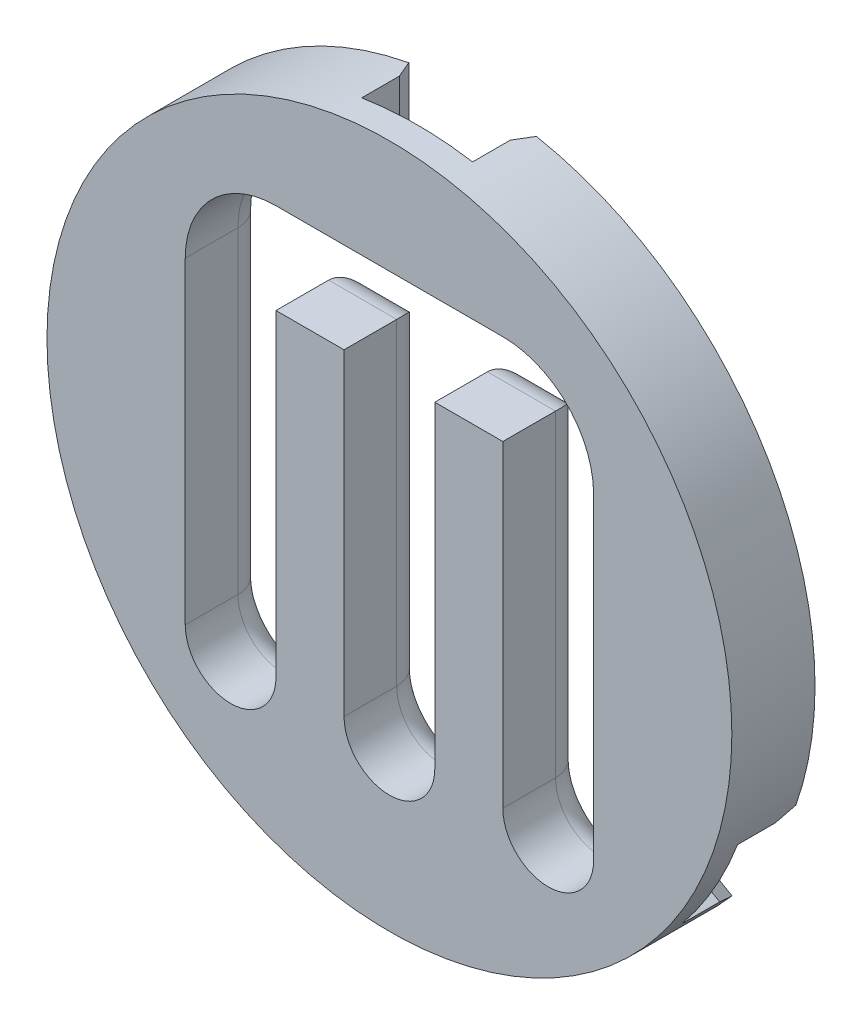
ISO-10303-21;
HEADER;
FILE_DESCRIPTION(('STEP AP214'),'2;1');
FILE_NAME('part.step','',(''),(''),'','','');
FILE_SCHEMA(('AUTOMOTIVE_DESIGN { 1 0 10303 214 1 1 1 1 }'));
ENDSEC;
DATA;
#1=APPLICATION_CONTEXT('core data for automotive mechanical design processes');
#2=APPLICATION_PROTOCOL_DEFINITION('international standard','automotive_design',2000,#1);
#3=PRODUCT_CONTEXT('',#1,'mechanical');
#4=PRODUCT('Part','Part','',(#3));
#5=PRODUCT_RELATED_PRODUCT_CATEGORY('part','',(#4));
#6=PRODUCT_DEFINITION_FORMATION('','',#4);
#7=PRODUCT_DEFINITION_CONTEXT('part definition',#1,'design');
#8=PRODUCT_DEFINITION('design','',#6,#7);
#9=PRODUCT_DEFINITION_SHAPE('','',#8);
#10=(LENGTH_UNIT() NAMED_UNIT(*) SI_UNIT(.MILLI.,.METRE.));
#11=(NAMED_UNIT(*) PLANE_ANGLE_UNIT() SI_UNIT($,.RADIAN.));
#12=(NAMED_UNIT(*) SI_UNIT($,.STERADIAN.) SOLID_ANGLE_UNIT());
#13=UNCERTAINTY_MEASURE_WITH_UNIT(LENGTH_MEASURE(1.E-05),#10,'distance_accuracy_value','');
#14=(GEOMETRIC_REPRESENTATION_CONTEXT(3) GLOBAL_UNCERTAINTY_ASSIGNED_CONTEXT((#13)) GLOBAL_UNIT_ASSIGNED_CONTEXT((#10,
#11,#12)) REPRESENTATION_CONTEXT('',''));
#15=CARTESIAN_POINT('',(0.,0.,0.));
#16=DIRECTION('',(0.,0.,1.));
#17=DIRECTION('',(1.,0.,0.));
#18=AXIS2_PLACEMENT_3D('',#15,#16,#17);
#19=CARTESIAN_POINT('',(0.,0.,0.));
#20=DIRECTION('',(0.,0.,1.));
#21=DIRECTION('',(1.,0.,0.));
#22=AXIS2_PLACEMENT_3D('',#19,#20,#21);
#23=PLANE('',#22);
#24=DIRECTION('',(0.866025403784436,0.500000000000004,0.));
#25=VECTOR('',#24,1.);
#26=CARTESIAN_POINT('',(1.15000000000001,-1.99185842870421,0.));
#27=LINE('',#26,#25);
#28=CARTESIAN_POINT('',(-9.35830029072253,-8.05882843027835,0.));
#29=VERTEX_POINT('',#28);
#30=CARTESIAN_POINT('',(-8.28119797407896,-7.43696311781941,0.));
#31=VERTEX_POINT('',#30);
#32=EDGE_CURVE('E610',#29,#31,#27,.T.);
#33=ORIENTED_EDGE('',*,*,#32,.T.);
#34=CARTESIAN_POINT('',(-5.727272,-6.454544,0.));
#35=DIRECTION('',(0.,0.,1.));
#36=DIRECTION('',(1.,0.,0.));
#37=AXIS2_PLACEMENT_3D('',#34,#35,#36);
#38=CIRCLE('',#37,2.7363635);
#39=CARTESIAN_POINT('',(-2.9909085,-6.45454400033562,0.));
#40=VERTEX_POINT('',#39);
#41=EDGE_CURVE('E701',#31,#40,#38,.T.);
#42=ORIENTED_EDGE('',*,*,#41,.T.);
#43=DIRECTION('',(0.,1.,0.));
#44=VECTOR('',#43,1.);
#45=CARTESIAN_POINT('',(-2.9909085,4.999999,0.));
#46=LINE('',#45,#44);
#47=CARTESIAN_POINT('',(-2.9909085,3.899999,0.));
#48=VERTEX_POINT('',#47);
#49=EDGE_CURVE('E695',#40,#48,#46,.T.);
#50=ORIENTED_EDGE('',*,*,#49,.T.);
#51=DIRECTION('',(1.,0.,0.));
#52=VECTOR('',#51,1.);
#53=CARTESIAN_POINT('',(-1.6363635,3.899999,0.));
#54=LINE('',#53,#52);
#55=CARTESIAN_POINT('',(-2.7363635,3.899999,0.));
#56=VERTEX_POINT('',#55);
#57=EDGE_CURVE('E692',#48,#56,#54,.T.);
#58=ORIENTED_EDGE('',*,*,#57,.T.);
#59=DIRECTION('',(0.,-1.,0.));
#60=VECTOR('',#59,1.);
#61=CARTESIAN_POINT('',(-2.7363635,-6.454543,0.));
#62=LINE('',#61,#60);
#63=CARTESIAN_POINT('',(-2.7363635,-6.454543,0.));
#64=VERTEX_POINT('',#63);
#65=EDGE_CURVE('E688',#56,#64,#62,.T.);
#66=ORIENTED_EDGE('',*,*,#65,.T.);
#67=CARTESIAN_POINT('',(0.,-6.454543,0.));
#68=DIRECTION('',(0.,0.,1.));
#69=DIRECTION('',(1.,0.,0.));
#70=AXIS2_PLACEMENT_3D('',#67,#68,#69);
#71=CIRCLE('',#70,2.7363635);
#72=CARTESIAN_POINT('',(2.7363635,-6.45454300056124,0.));
#73=VERTEX_POINT('',#72);
#74=EDGE_CURVE('E685',#64,#73,#71,.T.);
#75=ORIENTED_EDGE('',*,*,#74,.T.);
#76=DIRECTION('',(0.,1.,0.));
#77=VECTOR('',#76,1.);
#78=CARTESIAN_POINT('',(2.7363635,4.999999,0.));
#79=LINE('',#78,#77);
#80=CARTESIAN_POINT('',(2.7363635,3.899999,0.));
#81=VERTEX_POINT('',#80);
#82=EDGE_CURVE('E679',#73,#81,#79,.T.);
#83=ORIENTED_EDGE('',*,*,#82,.T.);
#84=DIRECTION('',(1.,0.,0.));
#85=VECTOR('',#84,1.);
#86=CARTESIAN_POINT('',(4.0909095,3.899999,0.));
#87=LINE('',#86,#85);
#88=CARTESIAN_POINT('',(2.9909095,3.899999,0.));
#89=VERTEX_POINT('',#88);
#90=EDGE_CURVE('E676',#81,#89,#87,.T.);
#91=ORIENTED_EDGE('',*,*,#90,.T.);
#92=DIRECTION('',(0.,-1.,0.));
#93=VECTOR('',#92,1.);
#94=CARTESIAN_POINT('',(2.9909095,-6.454547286,0.));
#95=LINE('',#94,#93);
#96=CARTESIAN_POINT('',(2.9909095,-6.454547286,0.));
#97=VERTEX_POINT('',#96);
#98=EDGE_CURVE('E682',#89,#97,#95,.T.);
#99=ORIENTED_EDGE('',*,*,#98,.T.);
#100=CARTESIAN_POINT('',(5.727273,-6.454547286,0.));
#101=DIRECTION('',(0.,0.,1.));
#102=DIRECTION('',(1.,0.,0.));
#103=AXIS2_PLACEMENT_3D('',#100,#101,#102);
#104=CIRCLE('',#103,2.7363635);
#105=CARTESIAN_POINT('',(8.28119982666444,-7.43696418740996,0.));
#106=VERTEX_POINT('',#105);
#107=EDGE_CURVE('E698',#97,#106,#104,.T.);
#108=ORIENTED_EDGE('',*,*,#107,.T.);
#109=DIRECTION('',(0.866025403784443,-0.499999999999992,0.));
#110=VECTOR('',#109,1.);
#111=CARTESIAN_POINT('',(-1.14999999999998,-1.99185842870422,0.));
#112=LINE('',#111,#110);
#113=CARTESIAN_POINT('',(9.35830029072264,-8.05882843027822,0.));
#114=VERTEX_POINT('',#113);
#115=EDGE_CURVE('E643',#106,#114,#112,.T.);
#116=ORIENTED_EDGE('',*,*,#115,.T.);
#117=CARTESIAN_POINT('',(0.,0.,0.));
#118=DIRECTION('',(0.,0.,1.));
#119=DIRECTION('',(1.,0.,0.));
#120=AXIS2_PLACEMENT_3D('',#117,#118,#119);
#121=CIRCLE('',#120,12.35);
#122=EDGE_CURVE('E544',#29,#114,#121,.T.);
#123=ORIENTED_EDGE('',*,*,#122,.F.);
#124=EDGE_LOOP('',(#33,#42,#50,#58,#66,#75,#83,#91,#99,#108,#116,#123));
#125=FACE_BOUND('',#124,.T.);
#126=ADVANCED_FACE('F40',(#125),#23,.F.);
#127=CARTESIAN_POINT('',(0.,0.,3.));
#128=DIRECTION('',(0.,0.,1.));
#129=DIRECTION('',(1.,0.,0.));
#130=AXIS2_PLACEMENT_3D('',#127,#128,#129);
#131=PLANE('',#130);
#132=CARTESIAN_POINT('',(0.,0.,3.));
#133=DIRECTION('',(0.,0.,1.));
#134=DIRECTION('',(1.,0.,0.));
#135=AXIS2_PLACEMENT_3D('',#132,#133,#134);
#136=CIRCLE('',#135,12.35);
#137=CARTESIAN_POINT('',(12.35,0.,3.));
#138=VERTEX_POINT('',#137);
#139=EDGE_CURVE('E535',#138,#138,#136,.T.);
#140=ORIENTED_EDGE('',*,*,#139,.T.);
#141=EDGE_LOOP('',(#140));
#142=FACE_BOUND('',#141,.T.);
#143=DIRECTION('',(1.,0.,0.));
#144=VECTOR('',#143,1.);
#145=CARTESIAN_POINT('',(-4.0909085,4.999999,3.));
#146=LINE('',#145,#144);
#147=CARTESIAN_POINT('',(-4.0909085,4.999999,3.));
#148=VERTEX_POINT('',#147);
#149=CARTESIAN_POINT('',(-1.6363635,4.999999,3.));
#150=VERTEX_POINT('',#149);
#151=EDGE_CURVE('E443',#148,#150,#146,.T.);
#152=ORIENTED_EDGE('',*,*,#151,.F.);
#153=DIRECTION('',(0.,1.,0.));
#154=VECTOR('',#153,1.);
#155=CARTESIAN_POINT('',(-4.0909085,-6.45454400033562,3.));
#156=LINE('',#155,#154);
#157=CARTESIAN_POINT('',(-4.0909085,-6.45454400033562,3.));
#158=VERTEX_POINT('',#157);
#159=EDGE_CURVE('E438',#158,#148,#156,.T.);
#160=ORIENTED_EDGE('',*,*,#159,.F.);
#161=CARTESIAN_POINT('',(-5.727272,-6.454544,3.));
#162=DIRECTION('',(0.,0.,1.));
#163=DIRECTION('',(1.,0.,0.));
#164=AXIS2_PLACEMENT_3D('',#161,#162,#163);
#165=CIRCLE('',#164,1.6363635);
#166=CARTESIAN_POINT('',(-7.3636355,-6.454544,3.));
#167=VERTEX_POINT('',#166);
#168=EDGE_CURVE('E480',#167,#158,#165,.T.);
#169=ORIENTED_EDGE('',*,*,#168,.F.);
#170=DIRECTION('',(0.,-1.,0.));
#171=VECTOR('',#170,1.);
#172=CARTESIAN_POINT('',(-7.3636355,4.999999,3.));
#173=LINE('',#172,#171);
#174=CARTESIAN_POINT('',(-7.3636355,4.999999,3.));
#175=VERTEX_POINT('',#174);
#176=EDGE_CURVE('E476',#175,#167,#173,.T.);
#177=ORIENTED_EDGE('',*,*,#176,.F.);
#178=CARTESIAN_POINT('',(-4.0909085,4.999999,3.));
#179=DIRECTION('',(0.,0.,1.));
#180=DIRECTION('',(1.,0.,0.));
#181=AXIS2_PLACEMENT_3D('',#178,#179,#180);
#182=CIRCLE('',#181,3.272727);
#183=CARTESIAN_POINT('',(-4.0909085,8.272726,3.));
#184=VERTEX_POINT('',#183);
#185=EDGE_CURVE('E473',#184,#175,#182,.T.);
#186=ORIENTED_EDGE('',*,*,#185,.F.);
#187=DIRECTION('',(-1.,0.,0.));
#188=VECTOR('',#187,1.);
#189=CARTESIAN_POINT('',(4.09090950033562,8.272726,3.));
#190=LINE('',#189,#188);
#191=CARTESIAN_POINT('',(4.09090950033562,8.272726,3.));
#192=VERTEX_POINT('',#191);
#193=EDGE_CURVE('E470',#192,#184,#190,.T.);
#194=ORIENTED_EDGE('',*,*,#193,.F.);
#195=CARTESIAN_POINT('',(4.0909095,4.999999,3.));
#196=DIRECTION('',(0.,0.,1.));
#197=DIRECTION('',(1.,0.,0.));
#198=AXIS2_PLACEMENT_3D('',#195,#196,#197);
#199=CIRCLE('',#198,3.272727);
#200=CARTESIAN_POINT('',(7.3636365,4.99999899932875,3.));
#201=VERTEX_POINT('',#200);
#202=EDGE_CURVE('E467',#201,#192,#199,.T.);
#203=ORIENTED_EDGE('',*,*,#202,.F.);
#204=DIRECTION('',(0.,1.,0.));
#205=VECTOR('',#204,1.);
#206=CARTESIAN_POINT('',(7.3636365,-6.45454728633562,3.));
#207=LINE('',#206,#205);
#208=CARTESIAN_POINT('',(7.3636365,-6.45454728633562,3.));
#209=VERTEX_POINT('',#208);
#210=EDGE_CURVE('E464',#209,#201,#207,.T.);
#211=ORIENTED_EDGE('',*,*,#210,.F.);
#212=CARTESIAN_POINT('',(5.727273,-6.454547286,3.));
#213=DIRECTION('',(0.,0.,1.));
#214=DIRECTION('',(1.,0.,0.));
#215=AXIS2_PLACEMENT_3D('',#212,#213,#214);
#216=CIRCLE('',#215,1.6363635);
#217=CARTESIAN_POINT('',(4.0909095,-6.454547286,3.));
#218=VERTEX_POINT('',#217);
#219=EDGE_CURVE('E461',#218,#209,#216,.T.);
#220=ORIENTED_EDGE('',*,*,#219,.F.);
#221=DIRECTION('',(0.,-1.,0.));
#222=VECTOR('',#221,1.);
#223=CARTESIAN_POINT('',(4.0909095,4.999999,3.));
#224=LINE('',#223,#222);
#225=CARTESIAN_POINT('',(4.0909095,4.999999,3.));
#226=VERTEX_POINT('',#225);
#227=EDGE_CURVE('E458',#226,#218,#224,.T.);
#228=ORIENTED_EDGE('',*,*,#227,.F.);
#229=DIRECTION('',(1.,0.,0.));
#230=VECTOR('',#229,1.);
#231=CARTESIAN_POINT('',(1.6363635,4.999999,3.));
#232=LINE('',#231,#230);
#233=CARTESIAN_POINT('',(1.6363635,4.999999,3.));
#234=VERTEX_POINT('',#233);
#235=EDGE_CURVE('E455',#234,#226,#232,.T.);
#236=ORIENTED_EDGE('',*,*,#235,.F.);
#237=DIRECTION('',(0.,1.,0.));
#238=VECTOR('',#237,1.);
#239=CARTESIAN_POINT('',(1.6363635,-6.45454300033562,3.));
#240=LINE('',#239,#238);
#241=CARTESIAN_POINT('',(1.6363635,-6.45454300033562,3.));
#242=VERTEX_POINT('',#241);
#243=EDGE_CURVE('E452',#242,#234,#240,.T.);
#244=ORIENTED_EDGE('',*,*,#243,.F.);
#245=CARTESIAN_POINT('',(0.,-6.454543,3.));
#246=DIRECTION('',(0.,0.,1.));
#247=DIRECTION('',(1.,0.,0.));
#248=AXIS2_PLACEMENT_3D('',#245,#246,#247);
#249=CIRCLE('',#248,1.6363635);
#250=CARTESIAN_POINT('',(-1.6363635,-6.454543,3.));
#251=VERTEX_POINT('',#250);
#252=EDGE_CURVE('E449',#251,#242,#249,.T.);
#253=ORIENTED_EDGE('',*,*,#252,.F.);
#254=DIRECTION('',(0.,-1.,0.));
#255=VECTOR('',#254,1.);
#256=CARTESIAN_POINT('',(-1.6363635,4.999999,3.));
#257=LINE('',#256,#255);
#258=EDGE_CURVE('E446',#150,#251,#257,.T.);
#259=ORIENTED_EDGE('',*,*,#258,.F.);
#260=EDGE_LOOP('',(#152,#160,#169,#177,#186,#194,#203,#211,#220,#228,#236,#244,#253,#259));
#261=FACE_BOUND('',#260,.T.);
#262=ADVANCED_FACE('F806',(#142,#261),#131,.T.);
#263=CARTESIAN_POINT('',(-4.0909085,4.999999,0.));
#264=DIRECTION('',(0.,0.,1.));
#265=DIRECTION('',(1.,0.,0.));
#266=AXIS2_PLACEMENT_3D('',#263,#264,#265);
#267=CIRCLE('',#266,4.372727);
#268=CARTESIAN_POINT('',(-4.0909085,9.372726,0.));
#269=VERTEX_POINT('',#268);
#270=CARTESIAN_POINT('',(-8.4636355,4.999999,0.));
#271=VERTEX_POINT('',#270);
#272=EDGE_CURVE('E670',#269,#271,#267,.T.);
#273=ORIENTED_EDGE('',*,*,#272,.T.);
#274=DIRECTION('',(0.,-1.,0.));
#275=VECTOR('',#274,1.);
#276=CARTESIAN_POINT('',(-8.4636355,-6.454544,0.));
#277=LINE('',#276,#275);
#278=CARTESIAN_POINT('',(-8.4636355,-5.44055329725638,0.));
#279=VERTEX_POINT('',#278);
#280=EDGE_CURVE('E673',#271,#279,#277,.T.);
#281=ORIENTED_EDGE('',*,*,#280,.T.);
#282=DIRECTION('',(-0.500000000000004,0.866025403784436,0.));
#283=VECTOR('',#282,1.);
#284=CARTESIAN_POINT('',(-8.70355530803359,-5.02500000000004,0.));
#285=LINE('',#284,#283);
#286=CARTESIAN_POINT('',(-9.8535553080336,-3.03314157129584,0.));
#287=VERTEX_POINT('',#286);
#288=EDGE_CURVE('E604',#279,#287,#285,.T.);
#289=ORIENTED_EDGE('',*,*,#288,.T.);
#290=DIRECTION('',(-0.866025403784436,-0.500000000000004,0.));
#291=VECTOR('',#290,1.);
#292=CARTESIAN_POINT('',(-1.15000000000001,1.9918584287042,0.));
#293=LINE('',#292,#291);
#294=CARTESIAN_POINT('',(-11.6583002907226,-4.07511157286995,0.));
#295=VERTEX_POINT('',#294);
#296=EDGE_CURVE('E607',#287,#295,#293,.T.);
#297=ORIENTED_EDGE('',*,*,#296,.T.);
#298=CARTESIAN_POINT('',(-2.3,12.1339400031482,0.));
#299=VERTEX_POINT('',#298);
#300=EDGE_CURVE('E540',#299,#295,#121,.T.);
#301=ORIENTED_EDGE('',*,*,#300,.F.);
#302=DIRECTION('',(0.,-1.,0.));
#303=VECTOR('',#302,1.);
#304=CARTESIAN_POINT('',(-2.3,0.,0.));
#305=LINE('',#304,#303);
#306=CARTESIAN_POINT('',(-2.3,10.05,0.));
#307=VERTEX_POINT('',#306);
#308=EDGE_CURVE('E564',#299,#307,#305,.T.);
#309=ORIENTED_EDGE('',*,*,#308,.T.);
#310=DIRECTION('',(1.,0.,0.));
#311=VECTOR('',#310,1.);
#312=CARTESIAN_POINT('',(0.,10.05,0.));
#313=LINE('',#312,#311);
#314=CARTESIAN_POINT('',(2.3,10.05,0.));
#315=VERTEX_POINT('',#314);
#316=EDGE_CURVE('E559',#307,#315,#313,.T.);
#317=ORIENTED_EDGE('',*,*,#316,.T.);
#318=DIRECTION('',(0.,1.,0.));
#319=VECTOR('',#318,1.);
#320=CARTESIAN_POINT('',(2.3,0.,0.));
#321=LINE('',#320,#319);
#322=CARTESIAN_POINT('',(2.3,12.1339400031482,0.));
#323=VERTEX_POINT('',#322);
#324=EDGE_CURVE('E561',#315,#323,#321,.T.);
#325=ORIENTED_EDGE('',*,*,#324,.T.);
#326=CARTESIAN_POINT('',(11.6583002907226,-4.07511157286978,0.));
#327=VERTEX_POINT('',#326);
#328=EDGE_CURVE('E534',#327,#323,#121,.T.);
#329=ORIENTED_EDGE('',*,*,#328,.F.);
#330=DIRECTION('',(-0.866025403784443,0.499999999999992,0.));
#331=VECTOR('',#330,1.);
#332=CARTESIAN_POINT('',(1.14999999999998,1.99185842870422,0.));
#333=LINE('',#332,#331);
#334=CARTESIAN_POINT('',(9.85355530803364,-3.0331415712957,0.));
#335=VERTEX_POINT('',#334);
#336=EDGE_CURVE('E646',#327,#335,#333,.T.);
#337=ORIENTED_EDGE('',*,*,#336,.T.);
#338=DIRECTION('',(-0.499999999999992,-0.866025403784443,0.));
#339=VECTOR('',#338,1.);
#340=CARTESIAN_POINT('',(8.70355530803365,-5.02499999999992,0.));
#341=LINE('',#340,#339);
#342=CARTESIAN_POINT('',(8.4636365,-5.44055156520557,0.));
#343=VERTEX_POINT('',#342);
#344=EDGE_CURVE('E639',#335,#343,#341,.T.);
#345=ORIENTED_EDGE('',*,*,#344,.T.);
#346=DIRECTION('',(0.,1.,0.));
#347=VECTOR('',#346,1.);
#348=CARTESIAN_POINT('',(8.4636365,4.99999899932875,0.));
#349=LINE('',#348,#347);
#350=CARTESIAN_POINT('',(8.4636365,4.99999899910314,0.));
#351=VERTEX_POINT('',#350);
#352=EDGE_CURVE('E654',#343,#351,#349,.T.);
#353=ORIENTED_EDGE('',*,*,#352,.T.);
#354=CARTESIAN_POINT('',(4.0909095,4.999999,0.));
#355=DIRECTION('',(0.,0.,1.));
#356=DIRECTION('',(1.,0.,0.));
#357=AXIS2_PLACEMENT_3D('',#354,#355,#356);
#358=CIRCLE('',#357,4.372727);
#359=CARTESIAN_POINT('',(4.09090950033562,9.372726,0.));
#360=VERTEX_POINT('',#359);
#361=EDGE_CURVE('E664',#351,#360,#358,.T.);
#362=ORIENTED_EDGE('',*,*,#361,.T.);
#363=DIRECTION('',(-1.,0.,0.));
#364=VECTOR('',#363,1.);
#365=CARTESIAN_POINT('',(-4.0909085,9.372726,0.));
#366=LINE('',#365,#364);
#367=EDGE_CURVE('E667',#360,#269,#366,.T.);
#368=ORIENTED_EDGE('',*,*,#367,.T.);
#369=EDGE_LOOP('',(#273,#281,#289,#297,#301,#309,#317,#325,#329,#337,#345,#353,#362,#368));
#370=FACE_BOUND('',#369,.T.);
#371=ADVANCED_FACE('F809',(#370),#23,.F.);
#372=CARTESIAN_POINT('',(0.,0.,3.));
#373=DIRECTION('',(0.,0.,-1.));
#374=DIRECTION('',(-1.,0.,0.));
#375=AXIS2_PLACEMENT_3D('',#372,#373,#374);
#376=CYLINDRICAL_SURFACE('',#375,12.35);
#377=ORIENTED_EDGE('',*,*,#139,.F.);
#378=EDGE_LOOP('',(#377));
#379=FACE_BOUND('',#378,.T.);
#380=DIRECTION('',(0.,0.,-1.));
#381=VECTOR('',#380,1.);
#382=CARTESIAN_POINT('',(11.5542349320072,-4.3614395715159,3.));
#383=LINE('',#382,#381);
#384=CARTESIAN_POINT('',(11.5542349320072,-4.3614395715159,2.));
#385=VERTEX_POINT('',#384);
#386=CARTESIAN_POINT('',(11.5542349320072,-4.3614395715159,0.643352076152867));
#387=VERTEX_POINT('',#386);
#388=EDGE_CURVE('E590',#385,#387,#383,.T.);
#389=ORIENTED_EDGE('',*,*,#388,.T.);
#390=CARTESIAN_POINT('',(0.,0.,4.93236591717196));
#391=DIRECTION('',(0.453153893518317,0.784885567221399,0.422618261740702));
#392=DIRECTION('',(0.211309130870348,0.365998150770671,-0.906307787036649));
#393=AXIS2_PLACEMENT_3D('',#390,#391,#392);
#394=ELLIPSE('',#393,29.2225895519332,12.35);
#395=EDGE_CURVE('E636',#387,#327,#394,.T.);
#396=ORIENTED_EDGE('',*,*,#395,.T.);
#397=ORIENTED_EDGE('',*,*,#328,.T.);
#398=CARTESIAN_POINT('',(0.,0.,4.93236591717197));
#399=DIRECTION('',(0.906307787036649,0.,0.422618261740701));
#400=DIRECTION('',(0.422618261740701,0.,-0.906307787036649));
#401=AXIS2_PLACEMENT_3D('',#398,#399,#400);
#402=ELLIPSE('',#401,29.2225895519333,12.35);
#403=CARTESIAN_POINT('',(2.,12.1869807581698,0.643352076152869));
#404=VERTEX_POINT('',#403);
#405=EDGE_CURVE('E555',#323,#404,#402,.T.);
#406=ORIENTED_EDGE('',*,*,#405,.T.);
#407=DIRECTION('',(0.,0.,-1.));
#408=VECTOR('',#407,1.);
#409=CARTESIAN_POINT('',(2.,12.1869807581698,3.));
#410=LINE('',#409,#408);
#411=CARTESIAN_POINT('',(2.,12.1869807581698,2.));
#412=VERTEX_POINT('',#411);
#413=EDGE_CURVE('E547',#404,#412,#410,.F.);
#414=ORIENTED_EDGE('',*,*,#413,.T.);
#415=CARTESIAN_POINT('',(0.,0.,2.));
#416=DIRECTION('',(0.,0.,-1.));
#417=DIRECTION('',(-1.,0.,0.));
#418=AXIS2_PLACEMENT_3D('',#415,#416,#417);
#419=CIRCLE('',#418,12.35);
#420=CARTESIAN_POINT('',(-2.,12.1869807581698,2.));
#421=VERTEX_POINT('',#420);
#422=EDGE_CURVE('E539',#421,#412,#419,.T.);
#423=ORIENTED_EDGE('',*,*,#422,.F.);
#424=DIRECTION('',(0.,0.,-1.));
#425=VECTOR('',#424,1.);
#426=CARTESIAN_POINT('',(-2.,12.1869807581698,3.));
#427=LINE('',#426,#425);
#428=CARTESIAN_POINT('',(-2.,12.1869807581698,0.643352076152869));
#429=VERTEX_POINT('',#428);
#430=EDGE_CURVE('E549',#421,#429,#427,.T.);
#431=ORIENTED_EDGE('',*,*,#430,.T.);
#432=CARTESIAN_POINT('',(0.,0.,4.93236591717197));
#433=DIRECTION('',(-0.906307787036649,0.,0.422618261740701));
#434=DIRECTION('',(-0.422618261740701,0.,-0.906307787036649));
#435=AXIS2_PLACEMENT_3D('',#432,#433,#434);
#436=ELLIPSE('',#435,29.2225895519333,12.35);
#437=EDGE_CURVE('E557',#429,#299,#436,.T.);
#438=ORIENTED_EDGE('',*,*,#437,.T.);
#439=ORIENTED_EDGE('',*,*,#300,.T.);
#440=CARTESIAN_POINT('',(0.,0.,4.93236591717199));
#441=DIRECTION('',(-0.453153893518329,0.784885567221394,0.422618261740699));
#442=DIRECTION('',(-0.211309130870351,0.365998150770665,-0.90630778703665));
#443=AXIS2_PLACEMENT_3D('',#440,#441,#442);
#444=ELLIPSE('',#443,29.2225895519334,12.35);
#445=CARTESIAN_POINT('',(-11.5542349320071,-4.36143957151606,0.643352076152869));
#446=VERTEX_POINT('',#445);
#447=EDGE_CURVE('E598',#295,#446,#444,.T.);
#448=ORIENTED_EDGE('',*,*,#447,.T.);
#449=DIRECTION('',(0.,0.,-1.));
#450=VECTOR('',#449,1.);
#451=CARTESIAN_POINT('',(-11.5542349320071,-4.36143957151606,3.));
#452=LINE('',#451,#450);
#453=CARTESIAN_POINT('',(-11.5542349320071,-4.36143957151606,2.));
#454=VERTEX_POINT('',#453);
#455=EDGE_CURVE('E578',#446,#454,#452,.F.);
#456=ORIENTED_EDGE('',*,*,#455,.T.);
#457=CARTESIAN_POINT('',(0.,0.,2.));
#458=DIRECTION('',(0.,0.,-1.));
#459=DIRECTION('',(-1.,0.,0.));
#460=AXIS2_PLACEMENT_3D('',#457,#458,#459);
#461=CIRCLE('',#460,12.35);
#462=CARTESIAN_POINT('',(-9.55423493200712,-7.82554118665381,2.));
#463=VERTEX_POINT('',#462);
#464=EDGE_CURVE('E570',#463,#454,#461,.T.);
#465=ORIENTED_EDGE('',*,*,#464,.F.);
#466=DIRECTION('',(0.,0.,-1.));
#467=VECTOR('',#466,1.);
#468=CARTESIAN_POINT('',(-9.55423493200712,-7.82554118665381,3.));
#469=LINE('',#468,#467);
#470=CARTESIAN_POINT('',(-9.55423493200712,-7.82554118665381,0.643352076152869));
#471=VERTEX_POINT('',#470);
#472=EDGE_CURVE('E581',#463,#471,#469,.T.);
#473=ORIENTED_EDGE('',*,*,#472,.T.);
#474=CARTESIAN_POINT('',(0.,0.,4.932365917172));
#475=DIRECTION('',(0.453153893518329,-0.784885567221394,0.422618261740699));
#476=DIRECTION('',(0.211309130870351,-0.365998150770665,-0.90630778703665));
#477=AXIS2_PLACEMENT_3D('',#474,#475,#476);
#478=ELLIPSE('',#477,29.2225895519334,12.35);
#479=EDGE_CURVE('E601',#471,#29,#478,.T.);
#480=ORIENTED_EDGE('',*,*,#479,.T.);
#481=ORIENTED_EDGE('',*,*,#122,.T.);
#482=CARTESIAN_POINT('',(0.,0.,4.93236591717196));
#483=DIRECTION('',(-0.453153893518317,-0.784885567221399,0.422618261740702));
#484=DIRECTION('',(-0.211309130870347,-0.365998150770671,-0.906307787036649));
#485=AXIS2_PLACEMENT_3D('',#482,#483,#484);
#486=ELLIPSE('',#485,29.2225895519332,12.35);
#487=CARTESIAN_POINT('',(9.55423493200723,-7.82554118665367,0.643352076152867));
#488=VERTEX_POINT('',#487);
#489=EDGE_CURVE('E633',#114,#488,#486,.T.);
#490=ORIENTED_EDGE('',*,*,#489,.T.);
#491=DIRECTION('',(0.,0.,-1.));
#492=VECTOR('',#491,1.);
#493=CARTESIAN_POINT('',(9.55423493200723,-7.82554118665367,3.));
#494=LINE('',#493,#492);
#495=CARTESIAN_POINT('',(9.55423493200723,-7.82554118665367,2.));
#496=VERTEX_POINT('',#495);
#497=EDGE_CURVE('E587',#488,#496,#494,.F.);
#498=ORIENTED_EDGE('',*,*,#497,.T.);
#499=CARTESIAN_POINT('',(0.,0.,2.));
#500=DIRECTION('',(0.,0.,-1.));
#501=DIRECTION('',(-1.,0.,0.));
#502=AXIS2_PLACEMENT_3D('',#499,#500,#501);
#503=CIRCLE('',#502,12.35);
#504=EDGE_CURVE('E381',#385,#496,#503,.T.);
#505=ORIENTED_EDGE('',*,*,#504,.F.);
#506=EDGE_LOOP('',(#389,#396,#397,#406,#414,#423,#431,#438,#439,#448,#456,#465,#473,#480,#481,
#490,#498,#505));
#507=FACE_BOUND('',#506,.T.);
#508=ADVANCED_FACE('F817',(#379,#507),#376,.T.);
#509=CARTESIAN_POINT('',(-4.0909085,-6.45454400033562,3.));
#510=DIRECTION('',(-1.,0.,0.));
#511=DIRECTION('',(0.,-1.,0.));
#512=AXIS2_PLACEMENT_3D('',#509,#510,#511);
#513=PLANE('',#512);
#514=DIRECTION('',(0.,0.,-1.));
#515=VECTOR('',#514,1.);
#516=CARTESIAN_POINT('',(-4.0909085,4.999999,3.));
#517=LINE('',#516,#515);
#518=CARTESIAN_POINT('',(-4.0909085,4.999999,1.1));
#519=VERTEX_POINT('',#518);
#520=EDGE_CURVE('E530',#148,#519,#517,.T.);
#521=ORIENTED_EDGE('',*,*,#520,.T.);
#522=DIRECTION('',(0.,1.,0.));
#523=VECTOR('',#522,1.);
#524=CARTESIAN_POINT('',(-4.0909085,-6.454544,1.1));
#525=LINE('',#524,#523);
#526=CARTESIAN_POINT('',(-4.0909085,-6.45454400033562,1.1));
#527=VERTEX_POINT('',#526);
#528=EDGE_CURVE('E845',#519,#527,#525,.F.);
#529=ORIENTED_EDGE('',*,*,#528,.T.);
#530=DIRECTION('',(0.,0.,-1.));
#531=VECTOR('',#530,1.);
#532=CARTESIAN_POINT('',(-4.0909085,-6.45454400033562,3.));
#533=LINE('',#532,#531);
#534=EDGE_CURVE('E483',#158,#527,#533,.T.);
#535=ORIENTED_EDGE('',*,*,#534,.F.);
#536=ORIENTED_EDGE('',*,*,#159,.T.);
#537=EDGE_LOOP('',(#521,#529,#535,#536));
#538=FACE_BOUND('',#537,.T.);
#539=ADVANCED_FACE('F822',(#538),#513,.T.);
#540=CARTESIAN_POINT('',(-4.0909085,4.999999,3.));
#541=DIRECTION('',(0.,1.,0.));
#542=DIRECTION('',(-1.,0.,0.));
#543=AXIS2_PLACEMENT_3D('',#540,#541,#542);
#544=PLANE('',#543);
#545=DIRECTION('',(0.,0.,-1.));
#546=VECTOR('',#545,1.);
#547=CARTESIAN_POINT('',(-1.6363635,4.999999,3.));
#548=LINE('',#547,#546);
#549=CARTESIAN_POINT('',(-1.6363635,4.999999,1.1));
#550=VERTEX_POINT('',#549);
#551=EDGE_CURVE('E526',#150,#550,#548,.T.);
#552=ORIENTED_EDGE('',*,*,#551,.T.);
#553=DIRECTION('',(1.,0.,0.));
#554=VECTOR('',#553,1.);
#555=CARTESIAN_POINT('',(-4.0909085,4.999999,1.1));
#556=LINE('',#555,#554);
#557=EDGE_CURVE('E888',#550,#519,#556,.F.);
#558=ORIENTED_EDGE('',*,*,#557,.T.);
#559=ORIENTED_EDGE('',*,*,#520,.F.);
#560=ORIENTED_EDGE('',*,*,#151,.T.);
#561=EDGE_LOOP('',(#552,#558,#559,#560));
#562=FACE_BOUND('',#561,.T.);
#563=ADVANCED_FACE('F1028',(#562),#544,.T.);
#564=CARTESIAN_POINT('',(-1.6363635,4.999999,3.));
#565=DIRECTION('',(1.,0.,0.));
#566=DIRECTION('',(0.,1.,0.));
#567=AXIS2_PLACEMENT_3D('',#564,#565,#566);
#568=PLANE('',#567);
#569=DIRECTION('',(0.,0.,-1.));
#570=VECTOR('',#569,1.);
#571=CARTESIAN_POINT('',(-1.6363635,-6.454543,3.));
#572=LINE('',#571,#570);
#573=CARTESIAN_POINT('',(-1.6363635,-6.454543,1.1));
#574=VERTEX_POINT('',#573);
#575=EDGE_CURVE('E522',#251,#574,#572,.T.);
#576=ORIENTED_EDGE('',*,*,#575,.T.);
#577=DIRECTION('',(0.,-1.,0.));
#578=VECTOR('',#577,1.);
#579=CARTESIAN_POINT('',(-1.6363635,4.999999,1.1));
#580=LINE('',#579,#578);
#581=EDGE_CURVE('E704',#574,#550,#580,.F.);
#582=ORIENTED_EDGE('',*,*,#581,.T.);
#583=ORIENTED_EDGE('',*,*,#551,.F.);
#584=ORIENTED_EDGE('',*,*,#258,.T.);
#585=EDGE_LOOP('',(#576,#582,#583,#584));
#586=FACE_BOUND('',#585,.T.);
#587=ADVANCED_FACE('F1024',(#586),#568,.T.);
#588=CARTESIAN_POINT('',(0.,-6.454543,3.));
#589=DIRECTION('',(0.,0.,-1.));
#590=DIRECTION('',(-1.,0.,0.));
#591=AXIS2_PLACEMENT_3D('',#588,#589,#590);
#592=CYLINDRICAL_SURFACE('',#591,1.6363635);
#593=DIRECTION('',(0.,0.,-1.));
#594=VECTOR('',#593,1.);
#595=CARTESIAN_POINT('',(1.6363635,-6.45454300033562,3.));
#596=LINE('',#595,#594);
#597=CARTESIAN_POINT('',(1.6363635,-6.45454300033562,1.1));
#598=VERTEX_POINT('',#597);
#599=EDGE_CURVE('E518',#242,#598,#596,.T.);
#600=ORIENTED_EDGE('',*,*,#599,.T.);
#601=CARTESIAN_POINT('',(0.,-6.454543,1.1));
#602=DIRECTION('',(0.,0.,1.));
#603=DIRECTION('',(1.,0.,0.));
#604=AXIS2_PLACEMENT_3D('',#601,#602,#603);
#605=CIRCLE('',#604,1.6363635);
#606=EDGE_CURVE('E708',#598,#574,#605,.F.);
#607=ORIENTED_EDGE('',*,*,#606,.T.);
#608=ORIENTED_EDGE('',*,*,#575,.F.);
#609=ORIENTED_EDGE('',*,*,#252,.T.);
#610=EDGE_LOOP('',(#600,#607,#608,#609));
#611=FACE_BOUND('',#610,.T.);
#612=ADVANCED_FACE('F1020',(#611),#592,.F.);
#613=CARTESIAN_POINT('',(1.6363635,-6.45454300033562,3.));
#614=DIRECTION('',(-1.,0.,0.));
#615=DIRECTION('',(0.,-1.,0.));
#616=AXIS2_PLACEMENT_3D('',#613,#614,#615);
#617=PLANE('',#616);
#618=DIRECTION('',(0.,0.,-1.));
#619=VECTOR('',#618,1.);
#620=CARTESIAN_POINT('',(1.6363635,4.999999,3.));
#621=LINE('',#620,#619);
#622=CARTESIAN_POINT('',(1.6363635,4.999999,1.1));
#623=VERTEX_POINT('',#622);
#624=EDGE_CURVE('E515',#234,#623,#621,.T.);
#625=ORIENTED_EDGE('',*,*,#624,.T.);
#626=DIRECTION('',(0.,1.,0.));
#627=VECTOR('',#626,1.);
#628=CARTESIAN_POINT('',(1.6363635,-6.45454300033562,1.1));
#629=LINE('',#628,#627);
#630=EDGE_CURVE('E885',#623,#598,#629,.F.);
#631=ORIENTED_EDGE('',*,*,#630,.T.);
#632=ORIENTED_EDGE('',*,*,#599,.F.);
#633=ORIENTED_EDGE('',*,*,#243,.T.);
#634=EDGE_LOOP('',(#625,#631,#632,#633));
#635=FACE_BOUND('',#634,.T.);
#636=ADVANCED_FACE('F1017',(#635),#617,.T.);
#637=CARTESIAN_POINT('',(1.6363635,4.999999,3.));
#638=DIRECTION('',(0.,1.,0.));
#639=DIRECTION('',(-1.,0.,0.));
#640=AXIS2_PLACEMENT_3D('',#637,#638,#639);
#641=PLANE('',#640);
#642=DIRECTION('',(0.,0.,-1.));
#643=VECTOR('',#642,1.);
#644=CARTESIAN_POINT('',(4.0909095,4.999999,3.));
#645=LINE('',#644,#643);
#646=CARTESIAN_POINT('',(4.0909095,4.999999,1.1));
#647=VERTEX_POINT('',#646);
#648=EDGE_CURVE('E512',#226,#647,#645,.T.);
#649=ORIENTED_EDGE('',*,*,#648,.T.);
#650=DIRECTION('',(1.,0.,0.));
#651=VECTOR('',#650,1.);
#652=CARTESIAN_POINT('',(1.6363635,4.999999,1.1));
#653=LINE('',#652,#651);
#654=EDGE_CURVE('E50',#647,#623,#653,.F.);
#655=ORIENTED_EDGE('',*,*,#654,.T.);
#656=ORIENTED_EDGE('',*,*,#624,.F.);
#657=ORIENTED_EDGE('',*,*,#235,.T.);
#658=EDGE_LOOP('',(#649,#655,#656,#657));
#659=FACE_BOUND('',#658,.T.);
#660=ADVANCED_FACE('F1014',(#659),#641,.T.);
#661=CARTESIAN_POINT('',(4.0909095,4.999999,3.));
#662=DIRECTION('',(1.,0.,0.));
#663=DIRECTION('',(0.,0.,-1.));
#664=AXIS2_PLACEMENT_3D('',#661,#662,#663);
#665=PLANE('',#664);
#666=DIRECTION('',(0.,0.,-1.));
#667=VECTOR('',#666,1.);
#668=CARTESIAN_POINT('',(4.0909095,-6.454547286,3.));
#669=LINE('',#668,#667);
#670=CARTESIAN_POINT('',(4.0909095,-6.454547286,1.1));
#671=VERTEX_POINT('',#670);
#672=EDGE_CURVE('E508',#218,#671,#669,.T.);
#673=ORIENTED_EDGE('',*,*,#672,.T.);
#674=DIRECTION('',(0.,-1.,0.));
#675=VECTOR('',#674,1.);
#676=CARTESIAN_POINT('',(4.0909095,4.999999,1.1));
#677=LINE('',#676,#675);
#678=EDGE_CURVE('E711',#671,#647,#677,.F.);
#679=ORIENTED_EDGE('',*,*,#678,.T.);
#680=ORIENTED_EDGE('',*,*,#648,.F.);
#681=ORIENTED_EDGE('',*,*,#227,.T.);
#682=EDGE_LOOP('',(#673,#679,#680,#681));
#683=FACE_BOUND('',#682,.T.);
#684=ADVANCED_FACE('F863',(#683),#665,.T.);
#685=CARTESIAN_POINT('',(5.727273,-6.454547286,3.));
#686=DIRECTION('',(0.,0.,-1.));
#687=DIRECTION('',(-1.,0.,0.));
#688=AXIS2_PLACEMENT_3D('',#685,#686,#687);
#689=CYLINDRICAL_SURFACE('',#688,1.6363635);
#690=DIRECTION('',(0.,0.,-1.));
#691=VECTOR('',#690,1.);
#692=CARTESIAN_POINT('',(7.3636365,-6.45454728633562,3.));
#693=LINE('',#692,#691);
#694=CARTESIAN_POINT('',(7.3636365,-6.45454728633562,1.1));
#695=VERTEX_POINT('',#694);
#696=EDGE_CURVE('E504',#209,#695,#693,.T.);
#697=ORIENTED_EDGE('',*,*,#696,.T.);
#698=CARTESIAN_POINT('',(5.727273,-6.454547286,1.1));
#699=DIRECTION('',(0.,0.,1.));
#700=DIRECTION('',(1.,0.,0.));
#701=AXIS2_PLACEMENT_3D('',#698,#699,#700);
#702=CIRCLE('',#701,1.6363635);
#703=EDGE_CURVE('E751',#695,#671,#702,.F.);
#704=ORIENTED_EDGE('',*,*,#703,.T.);
#705=ORIENTED_EDGE('',*,*,#672,.F.);
#706=ORIENTED_EDGE('',*,*,#219,.T.);
#707=EDGE_LOOP('',(#697,#704,#705,#706));
#708=FACE_BOUND('',#707,.T.);
#709=ADVANCED_FACE('F856',(#708),#689,.F.);
#710=CARTESIAN_POINT('',(7.3636365,-6.45454728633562,3.));
#711=DIRECTION('',(-1.,0.,0.));
#712=DIRECTION('',(0.,-1.,0.));
#713=AXIS2_PLACEMENT_3D('',#710,#711,#712);
#714=PLANE('',#713);
#715=DIRECTION('',(0.,0.,-1.));
#716=VECTOR('',#715,1.);
#717=CARTESIAN_POINT('',(7.3636365,4.99999899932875,3.));
#718=LINE('',#717,#716);
#719=CARTESIAN_POINT('',(7.3636365,4.99999899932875,1.1));
#720=VERTEX_POINT('',#719);
#721=EDGE_CURVE('E501',#201,#720,#718,.T.);
#722=ORIENTED_EDGE('',*,*,#721,.T.);
#723=DIRECTION('',(0.,1.,0.));
#724=VECTOR('',#723,1.);
#725=CARTESIAN_POINT('',(7.3636365,-6.45454728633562,1.1));
#726=LINE('',#725,#724);
#727=EDGE_CURVE('E11',#720,#695,#726,.F.);
#728=ORIENTED_EDGE('',*,*,#727,.T.);
#729=ORIENTED_EDGE('',*,*,#696,.F.);
#730=ORIENTED_EDGE('',*,*,#210,.T.);
#731=EDGE_LOOP('',(#722,#728,#729,#730));
#732=FACE_BOUND('',#731,.T.);
#733=ADVANCED_FACE('F1006',(#732),#714,.T.);
#734=CARTESIAN_POINT('',(4.0909095,4.999999,3.));
#735=DIRECTION('',(0.,0.,-1.));
#736=DIRECTION('',(-1.,0.,0.));
#737=AXIS2_PLACEMENT_3D('',#734,#735,#736);
#738=CYLINDRICAL_SURFACE('',#737,3.272727);
#739=DIRECTION('',(0.,0.,-1.));
#740=VECTOR('',#739,1.);
#741=CARTESIAN_POINT('',(4.09090950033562,8.272726,3.));
#742=LINE('',#741,#740);
#743=CARTESIAN_POINT('',(4.09090950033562,8.272726,1.1));
#744=VERTEX_POINT('',#743);
#745=EDGE_CURVE('E499',#192,#744,#742,.T.);
#746=ORIENTED_EDGE('',*,*,#745,.T.);
#747=CARTESIAN_POINT('',(4.0909095,4.999999,1.1));
#748=DIRECTION('',(0.,0.,1.));
#749=DIRECTION('',(1.,0.,0.));
#750=AXIS2_PLACEMENT_3D('',#747,#748,#749);
#751=CIRCLE('',#750,3.272727);
#752=EDGE_CURVE('E71',#744,#720,#751,.F.);
#753=ORIENTED_EDGE('',*,*,#752,.T.);
#754=ORIENTED_EDGE('',*,*,#721,.F.);
#755=ORIENTED_EDGE('',*,*,#202,.T.);
#756=EDGE_LOOP('',(#746,#753,#754,#755));
#757=FACE_BOUND('',#756,.T.);
#758=ADVANCED_FACE('F1002',(#757),#738,.F.);
#759=CARTESIAN_POINT('',(4.09090950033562,8.272726,3.));
#760=DIRECTION('',(0.,-1.,0.));
#761=DIRECTION('',(0.,0.,-1.));
#762=AXIS2_PLACEMENT_3D('',#759,#760,#761);
#763=PLANE('',#762);
#764=DIRECTION('',(0.,0.,-1.));
#765=VECTOR('',#764,1.);
#766=CARTESIAN_POINT('',(-4.0909085,8.272726,3.));
#767=LINE('',#766,#765);
#768=CARTESIAN_POINT('',(-4.0909085,8.272726,1.1));
#769=VERTEX_POINT('',#768);
#770=EDGE_CURVE('E495',#184,#769,#767,.T.);
#771=ORIENTED_EDGE('',*,*,#770,.T.);
#772=DIRECTION('',(-1.,0.,0.));
#773=VECTOR('',#772,1.);
#774=CARTESIAN_POINT('',(4.09090950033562,8.272726,1.1));
#775=LINE('',#774,#773);
#776=EDGE_CURVE('E1070',#769,#744,#775,.F.);
#777=ORIENTED_EDGE('',*,*,#776,.T.);
#778=ORIENTED_EDGE('',*,*,#745,.F.);
#779=ORIENTED_EDGE('',*,*,#193,.T.);
#780=EDGE_LOOP('',(#771,#777,#778,#779));
#781=FACE_BOUND('',#780,.T.);
#782=ADVANCED_FACE('F998',(#781),#763,.T.);
#783=CARTESIAN_POINT('',(-4.0909085,4.999999,3.));
#784=DIRECTION('',(0.,0.,-1.));
#785=DIRECTION('',(-1.,0.,0.));
#786=AXIS2_PLACEMENT_3D('',#783,#784,#785);
#787=CYLINDRICAL_SURFACE('',#786,3.272727);
#788=DIRECTION('',(0.,0.,-1.));
#789=VECTOR('',#788,1.);
#790=CARTESIAN_POINT('',(-7.3636355,4.999999,3.));
#791=LINE('',#790,#789);
#792=CARTESIAN_POINT('',(-7.3636355,4.999999,1.1));
#793=VERTEX_POINT('',#792);
#794=EDGE_CURVE('E491',#175,#793,#791,.T.);
#795=ORIENTED_EDGE('',*,*,#794,.T.);
#796=CARTESIAN_POINT('',(-4.0909085,4.999999,1.1));
#797=DIRECTION('',(0.,0.,1.));
#798=DIRECTION('',(1.,0.,0.));
#799=AXIS2_PLACEMENT_3D('',#796,#797,#798);
#800=CIRCLE('',#799,3.272727);
#801=EDGE_CURVE('E835',#793,#769,#800,.F.);
#802=ORIENTED_EDGE('',*,*,#801,.T.);
#803=ORIENTED_EDGE('',*,*,#770,.F.);
#804=ORIENTED_EDGE('',*,*,#185,.T.);
#805=EDGE_LOOP('',(#795,#802,#803,#804));
#806=FACE_BOUND('',#805,.T.);
#807=ADVANCED_FACE('F994',(#806),#787,.F.);
#808=CARTESIAN_POINT('',(-7.3636355,4.999999,3.));
#809=DIRECTION('',(1.,0.,0.));
#810=DIRECTION('',(0.,0.,-1.));
#811=AXIS2_PLACEMENT_3D('',#808,#809,#810);
#812=PLANE('',#811);
#813=DIRECTION('',(0.,0.,-1.));
#814=VECTOR('',#813,1.);
#815=CARTESIAN_POINT('',(-7.3636355,-6.454544,3.));
#816=LINE('',#815,#814);
#817=CARTESIAN_POINT('',(-7.3636355,-6.454544,1.1));
#818=VERTEX_POINT('',#817);
#819=EDGE_CURVE('E487',#167,#818,#816,.T.);
#820=ORIENTED_EDGE('',*,*,#819,.T.);
#821=DIRECTION('',(0.,-1.,0.));
#822=VECTOR('',#821,1.);
#823=CARTESIAN_POINT('',(-7.3636355,4.999999,1.1));
#824=LINE('',#823,#822);
#825=EDGE_CURVE('E1081',#818,#793,#824,.F.);
#826=ORIENTED_EDGE('',*,*,#825,.T.);
#827=ORIENTED_EDGE('',*,*,#794,.F.);
#828=ORIENTED_EDGE('',*,*,#176,.T.);
#829=EDGE_LOOP('',(#820,#826,#827,#828));
#830=FACE_BOUND('',#829,.T.);
#831=ADVANCED_FACE('F990',(#830),#812,.T.);
#832=CARTESIAN_POINT('',(-5.727272,-6.454544,3.));
#833=DIRECTION('',(0.,0.,-1.));
#834=DIRECTION('',(-1.,0.,0.));
#835=AXIS2_PLACEMENT_3D('',#832,#833,#834);
#836=CYLINDRICAL_SURFACE('',#835,1.6363635);
#837=ORIENTED_EDGE('',*,*,#534,.T.);
#838=CARTESIAN_POINT('',(-5.727272,-6.454544,1.1));
#839=DIRECTION('',(0.,0.,1.));
#840=DIRECTION('',(1.,0.,0.));
#841=AXIS2_PLACEMENT_3D('',#838,#839,#840);
#842=CIRCLE('',#841,1.6363635);
#843=EDGE_CURVE('E912',#527,#818,#842,.F.);
#844=ORIENTED_EDGE('',*,*,#843,.T.);
#845=ORIENTED_EDGE('',*,*,#819,.F.);
#846=ORIENTED_EDGE('',*,*,#168,.T.);
#847=EDGE_LOOP('',(#837,#844,#845,#846));
#848=FACE_BOUND('',#847,.T.);
#849=ADVANCED_FACE('F987',(#848),#836,.F.);
#850=CARTESIAN_POINT('',(-2.,14.35,2.));
#851=DIRECTION('',(-1.,0.,0.));
#852=DIRECTION('',(0.,0.,1.));
#853=AXIS2_PLACEMENT_3D('',#850,#851,#852);
#854=PLANE('',#853);
#855=DIRECTION('',(0.,0.,-1.));
#856=VECTOR('',#855,1.);
#857=CARTESIAN_POINT('',(-2.,10.35,2.));
#858=LINE('',#857,#856);
#859=CARTESIAN_POINT('',(-2.,10.35,2.));
#860=VERTEX_POINT('',#859);
#861=CARTESIAN_POINT('',(-2.,10.35,0.643352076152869));
#862=VERTEX_POINT('',#861);
#863=EDGE_CURVE('E435',#860,#862,#858,.T.);
#864=ORIENTED_EDGE('',*,*,#863,.T.);
#865=DIRECTION('',(0.,1.,0.));
#866=VECTOR('',#865,1.);
#867=CARTESIAN_POINT('',(-2.,14.35,0.643352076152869));
#868=LINE('',#867,#866);
#869=EDGE_CURVE('E552',#862,#429,#868,.T.);
#870=ORIENTED_EDGE('',*,*,#869,.T.);
#871=ORIENTED_EDGE('',*,*,#430,.F.);
#872=DIRECTION('',(0.,1.,0.));
#873=VECTOR('',#872,1.);
#874=CARTESIAN_POINT('',(-2.,14.35,2.));
#875=LINE('',#874,#873);
#876=EDGE_CURVE('E426',#860,#421,#875,.T.);
#877=ORIENTED_EDGE('',*,*,#876,.F.);
#878=EDGE_LOOP('',(#864,#870,#871,#877));
#879=FACE_BOUND('',#878,.T.);
#880=ADVANCED_FACE('F950',(#879),#854,.F.);
#881=CARTESIAN_POINT('',(2.,14.35,2.));
#882=DIRECTION('',(1.,0.,0.));
#883=DIRECTION('',(0.,1.,0.));
#884=AXIS2_PLACEMENT_3D('',#881,#882,#883);
#885=PLANE('',#884);
#886=ORIENTED_EDGE('',*,*,#413,.F.);
#887=DIRECTION('',(0.,-1.,0.));
#888=VECTOR('',#887,1.);
#889=CARTESIAN_POINT('',(2.,14.35,0.643352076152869));
#890=LINE('',#889,#888);
#891=CARTESIAN_POINT('',(2.,10.35,0.643352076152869));
#892=VERTEX_POINT('',#891);
#893=EDGE_CURVE('E566',#404,#892,#890,.T.);
#894=ORIENTED_EDGE('',*,*,#893,.T.);
#895=DIRECTION('',(0.,0.,-1.));
#896=VECTOR('',#895,1.);
#897=CARTESIAN_POINT('',(2.,10.35,2.));
#898=LINE('',#897,#896);
#899=CARTESIAN_POINT('',(2.,10.35,2.));
#900=VERTEX_POINT('',#899);
#901=EDGE_CURVE('E434',#900,#892,#898,.T.);
#902=ORIENTED_EDGE('',*,*,#901,.F.);
#903=DIRECTION('',(0.,-1.,0.));
#904=VECTOR('',#903,1.);
#905=CARTESIAN_POINT('',(2.,14.35,2.));
#906=LINE('',#905,#904);
#907=EDGE_CURVE('E428',#412,#900,#906,.T.);
#908=ORIENTED_EDGE('',*,*,#907,.F.);
#909=EDGE_LOOP('',(#886,#894,#902,#908));
#910=FACE_BOUND('',#909,.T.);
#911=ADVANCED_FACE('F969',(#910),#885,.F.);
#912=CARTESIAN_POINT('',(-2.,10.35,2.));
#913=DIRECTION('',(0.,0.,-1.));
#914=DIRECTION('',(-1.,0.,0.));
#915=AXIS2_PLACEMENT_3D('',#912,#913,#914);
#916=PLANE('',#915);
#917=ORIENTED_EDGE('',*,*,#422,.T.);
#918=ORIENTED_EDGE('',*,*,#907,.T.);
#919=DIRECTION('',(-1.,0.,0.));
#920=VECTOR('',#919,1.);
#921=CARTESIAN_POINT('',(2.,10.35,2.));
#922=LINE('',#921,#920);
#923=EDGE_CURVE('E431',#900,#860,#922,.T.);
#924=ORIENTED_EDGE('',*,*,#923,.T.);
#925=ORIENTED_EDGE('',*,*,#876,.T.);
#926=EDGE_LOOP('',(#917,#918,#924,#925));
#927=FACE_BOUND('',#926,.T.);
#928=ADVANCED_FACE('F972',(#927),#916,.T.);
#929=CARTESIAN_POINT('',(2.,10.35,2.));
#930=DIRECTION('',(0.,-1.,0.));
#931=DIRECTION('',(0.,0.,-1.));
#932=AXIS2_PLACEMENT_3D('',#929,#930,#931);
#933=PLANE('',#932);
#934=ORIENTED_EDGE('',*,*,#901,.T.);
#935=DIRECTION('',(-1.,0.,0.));
#936=VECTOR('',#935,1.);
#937=CARTESIAN_POINT('',(2.,10.35,0.643352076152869));
#938=LINE('',#937,#936);
#939=EDGE_CURVE('E568',#892,#862,#938,.T.);
#940=ORIENTED_EDGE('',*,*,#939,.T.);
#941=ORIENTED_EDGE('',*,*,#863,.F.);
#942=ORIENTED_EDGE('',*,*,#923,.F.);
#943=EDGE_LOOP('',(#934,#940,#941,#942));
#944=FACE_BOUND('',#943,.T.);
#945=ADVANCED_FACE('F973',(#944),#933,.F.);
#946=CARTESIAN_POINT('',(2.,14.35,0.643352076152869));
#947=DIRECTION('',(0.906307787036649,0.,0.422618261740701));
#948=DIRECTION('',(0.422618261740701,0.,-0.906307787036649));
#949=AXIS2_PLACEMENT_3D('',#946,#947,#948);
#950=PLANE('',#949);
#951=ORIENTED_EDGE('',*,*,#405,.F.);
#952=ORIENTED_EDGE('',*,*,#324,.F.);
#953=DIRECTION('',(0.389281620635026,-0.389281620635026,-0.834817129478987));
#954=VECTOR('',#953,1.);
#955=CARTESIAN_POINT('',(1.39383927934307,10.9561607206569,1.94326793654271));
#956=LINE('',#955,#954);
#957=EDGE_CURVE('E429',#892,#315,#956,.T.);
#958=ORIENTED_EDGE('',*,*,#957,.F.);
#959=ORIENTED_EDGE('',*,*,#893,.F.);
#960=EDGE_LOOP('',(#951,#952,#958,#959));
#961=FACE_BOUND('',#960,.T.);
#962=ADVANCED_FACE('F964',(#961),#950,.F.);
#963=CARTESIAN_POINT('',(2.,10.35,0.643352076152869));
#964=DIRECTION('',(0.,-0.906307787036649,0.422618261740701));
#965=DIRECTION('',(0.,-0.422618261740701,-0.906307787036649));
#966=AXIS2_PLACEMENT_3D('',#963,#964,#965);
#967=PLANE('',#966);
#968=ORIENTED_EDGE('',*,*,#957,.T.);
#969=ORIENTED_EDGE('',*,*,#316,.F.);
#970=DIRECTION('',(0.389281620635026,0.389281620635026,0.834817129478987));
#971=VECTOR('',#970,1.);
#972=CARTESIAN_POINT('',(-1.39383927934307,10.9561607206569,1.94326793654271));
#973=LINE('',#972,#971);
#974=EDGE_CURVE('E422',#862,#307,#973,.F.);
#975=ORIENTED_EDGE('',*,*,#974,.F.);
#976=ORIENTED_EDGE('',*,*,#939,.F.);
#977=EDGE_LOOP('',(#968,#969,#975,#976));
#978=FACE_BOUND('',#977,.T.);
#979=ADVANCED_FACE('F958',(#978),#967,.F.);
#980=CARTESIAN_POINT('',(-2.,14.35,0.643352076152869));
#981=DIRECTION('',(-0.906307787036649,0.,0.422618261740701));
#982=DIRECTION('',(0.422618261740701,0.,0.906307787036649));
#983=AXIS2_PLACEMENT_3D('',#980,#981,#982);
#984=PLANE('',#983);
#985=ORIENTED_EDGE('',*,*,#974,.T.);
#986=ORIENTED_EDGE('',*,*,#308,.F.);
#987=ORIENTED_EDGE('',*,*,#437,.F.);
#988=ORIENTED_EDGE('',*,*,#869,.F.);
#989=EDGE_LOOP('',(#985,#986,#987,#988));
#990=FACE_BOUND('',#989,.T.);
#991=ADVANCED_FACE('F948',(#990),#984,.F.);
#992=CARTESIAN_POINT('',(-11.4274645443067,-8.90705080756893,2.));
#993=DIRECTION('',(0.500000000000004,-0.866025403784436,0.));
#994=DIRECTION('',(0.866025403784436,0.500000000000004,0.));
#995=AXIS2_PLACEMENT_3D('',#992,#993,#994);
#996=PLANE('',#995);
#997=DIRECTION('',(0.,0.,-1.));
#998=VECTOR('',#997,1.);
#999=CARTESIAN_POINT('',(-7.96336292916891,-6.90705080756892,2.));
#1000=LINE('',#999,#998);
#1001=CARTESIAN_POINT('',(-7.96336292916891,-6.90705080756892,2.));
#1002=VERTEX_POINT('',#1001);
#1003=CARTESIAN_POINT('',(-7.96336292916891,-6.90705080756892,0.643352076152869));
#1004=VERTEX_POINT('',#1003);
#1005=EDGE_CURVE('E418',#1002,#1004,#1000,.T.);
#1006=ORIENTED_EDGE('',*,*,#1005,.T.);
#1007=DIRECTION('',(-0.866025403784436,-0.500000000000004,0.));
#1008=VECTOR('',#1007,1.);
#1009=CARTESIAN_POINT('',(-11.4274645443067,-8.90705080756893,0.643352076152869));
#1010=LINE('',#1009,#1008);
#1011=EDGE_CURVE('E594',#1004,#471,#1010,.T.);
#1012=ORIENTED_EDGE('',*,*,#1011,.T.);
#1013=ORIENTED_EDGE('',*,*,#472,.F.);
#1014=DIRECTION('',(-0.866025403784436,-0.500000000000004,0.));
#1015=VECTOR('',#1014,1.);
#1016=CARTESIAN_POINT('',(-11.4274645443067,-8.90705080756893,2.));
#1017=LINE('',#1016,#1015);
#1018=EDGE_CURVE('E406',#1002,#463,#1017,.T.);
#1019=ORIENTED_EDGE('',*,*,#1018,.F.);
#1020=EDGE_LOOP('',(#1006,#1012,#1013,#1019));
#1021=FACE_BOUND('',#1020,.T.);
#1022=ADVANCED_FACE('F922',(#1021),#996,.F.);
#1023=CARTESIAN_POINT('',(-13.4274645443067,-5.44294919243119,2.));
#1024=DIRECTION('',(-0.500000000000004,0.866025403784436,0.));
#1025=DIRECTION('',(-0.866025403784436,-0.500000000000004,0.));
#1026=AXIS2_PLACEMENT_3D('',#1023,#1024,#1025);
#1027=PLANE('',#1026);
#1028=ORIENTED_EDGE('',*,*,#455,.F.);
#1029=DIRECTION('',(0.866025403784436,0.500000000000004,0.));
#1030=VECTOR('',#1029,1.);
#1031=CARTESIAN_POINT('',(-13.4274645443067,-5.44294919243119,0.643352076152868));
#1032=LINE('',#1031,#1030);
#1033=CARTESIAN_POINT('',(-9.96336292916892,-3.44294919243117,0.643352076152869));
#1034=VERTEX_POINT('',#1033);
#1035=EDGE_CURVE('E614',#446,#1034,#1032,.T.);
#1036=ORIENTED_EDGE('',*,*,#1035,.T.);
#1037=DIRECTION('',(0.,0.,-1.));
#1038=VECTOR('',#1037,1.);
#1039=CARTESIAN_POINT('',(-9.96336292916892,-3.44294919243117,2.));
#1040=LINE('',#1039,#1038);
#1041=CARTESIAN_POINT('',(-9.96336292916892,-3.44294919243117,2.));
#1042=VERTEX_POINT('',#1041);
#1043=EDGE_CURVE('E417',#1042,#1034,#1040,.T.);
#1044=ORIENTED_EDGE('',*,*,#1043,.F.);
#1045=DIRECTION('',(0.866025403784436,0.500000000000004,0.));
#1046=VECTOR('',#1045,1.);
#1047=CARTESIAN_POINT('',(-13.4274645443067,-5.44294919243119,2.));
#1048=LINE('',#1047,#1046);
#1049=EDGE_CURVE('E410',#454,#1042,#1048,.T.);
#1050=ORIENTED_EDGE('',*,*,#1049,.F.);
#1051=EDGE_LOOP('',(#1028,#1036,#1044,#1050));
#1052=FACE_BOUND('',#1051,.T.);
#1053=ADVANCED_FACE('F934',(#1052),#1027,.F.);
#1054=CARTESIAN_POINT('',(-7.96336292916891,-6.90705080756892,2.));
#1055=DIRECTION('',(0.,0.,-1.));
#1056=DIRECTION('',(0.500000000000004,-0.866025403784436,0.));
#1057=AXIS2_PLACEMENT_3D('',#1054,#1055,#1056);
#1058=PLANE('',#1057);
#1059=ORIENTED_EDGE('',*,*,#464,.T.);
#1060=ORIENTED_EDGE('',*,*,#1049,.T.);
#1061=DIRECTION('',(0.500000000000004,-0.866025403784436,0.));
#1062=VECTOR('',#1061,1.);
#1063=CARTESIAN_POINT('',(-9.96336292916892,-3.44294919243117,2.));
#1064=LINE('',#1063,#1062);
#1065=EDGE_CURVE('E413',#1042,#1002,#1064,.T.);
#1066=ORIENTED_EDGE('',*,*,#1065,.T.);
#1067=ORIENTED_EDGE('',*,*,#1018,.T.);
#1068=EDGE_LOOP('',(#1059,#1060,#1066,#1067));
#1069=FACE_BOUND('',#1068,.T.);
#1070=ADVANCED_FACE('F931',(#1069),#1058,.T.);
#1071=CARTESIAN_POINT('',(-9.96336292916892,-3.44294919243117,2.));
#1072=DIRECTION('',(0.866025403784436,0.500000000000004,0.));
#1073=DIRECTION('',(-0.500000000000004,0.866025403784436,0.));
#1074=AXIS2_PLACEMENT_3D('',#1071,#1072,#1073);
#1075=PLANE('',#1074);
#1076=ORIENTED_EDGE('',*,*,#1043,.T.);
#1077=DIRECTION('',(0.500000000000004,-0.866025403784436,0.));
#1078=VECTOR('',#1077,1.);
#1079=CARTESIAN_POINT('',(-9.96336292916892,-3.44294919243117,0.643352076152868));
#1080=LINE('',#1079,#1078);
#1081=EDGE_CURVE('E617',#1034,#1004,#1080,.T.);
#1082=ORIENTED_EDGE('',*,*,#1081,.T.);
#1083=ORIENTED_EDGE('',*,*,#1005,.F.);
#1084=ORIENTED_EDGE('',*,*,#1065,.F.);
#1085=EDGE_LOOP('',(#1076,#1082,#1083,#1084));
#1086=FACE_BOUND('',#1085,.T.);
#1087=ADVANCED_FACE('F939',(#1086),#1075,.F.);
#1088=CARTESIAN_POINT('',(13.4274645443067,-5.442949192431,2.));
#1089=DIRECTION('',(0.499999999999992,0.866025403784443,0.));
#1090=DIRECTION('',(-0.866025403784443,0.499999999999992,0.));
#1091=AXIS2_PLACEMENT_3D('',#1088,#1089,#1090);
#1092=PLANE('',#1091);
#1093=DIRECTION('',(0.,0.,-1.));
#1094=VECTOR('',#1093,1.);
#1095=CARTESIAN_POINT('',(9.96336292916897,-3.44294919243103,2.));
#1096=LINE('',#1095,#1094);
#1097=CARTESIAN_POINT('',(9.96336292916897,-3.44294919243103,2.));
#1098=VERTEX_POINT('',#1097);
#1099=CARTESIAN_POINT('',(9.96336292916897,-3.44294919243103,0.643352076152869));
#1100=VERTEX_POINT('',#1099);
#1101=EDGE_CURVE('E395',#1098,#1100,#1096,.T.);
#1102=ORIENTED_EDGE('',*,*,#1101,.T.);
#1103=DIRECTION('',(0.866025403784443,-0.499999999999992,0.));
#1104=VECTOR('',#1103,1.);
#1105=CARTESIAN_POINT('',(13.4274645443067,-5.442949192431,0.643352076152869));
#1106=LINE('',#1105,#1104);
#1107=EDGE_CURVE('E620',#1100,#387,#1106,.T.);
#1108=ORIENTED_EDGE('',*,*,#1107,.T.);
#1109=ORIENTED_EDGE('',*,*,#388,.F.);
#1110=DIRECTION('',(0.866025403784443,-0.499999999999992,0.));
#1111=VECTOR('',#1110,1.);
#1112=CARTESIAN_POINT('',(13.4274645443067,-5.442949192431,2.));
#1113=LINE('',#1112,#1111);
#1114=EDGE_CURVE('E385',#1098,#385,#1113,.T.);
#1115=ORIENTED_EDGE('',*,*,#1114,.F.);
#1116=EDGE_LOOP('',(#1102,#1108,#1109,#1115));
#1117=FACE_BOUND('',#1116,.T.);
#1118=ADVANCED_FACE('F1119',(#1117),#1092,.F.);
#1119=CARTESIAN_POINT('',(11.4274645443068,-8.90705080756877,2.));
#1120=DIRECTION('',(-0.499999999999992,-0.866025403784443,0.));
#1121=DIRECTION('',(0.866025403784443,-0.499999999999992,0.));
#1122=AXIS2_PLACEMENT_3D('',#1119,#1120,#1121);
#1123=PLANE('',#1122);
#1124=ORIENTED_EDGE('',*,*,#497,.F.);
#1125=DIRECTION('',(-0.866025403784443,0.499999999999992,0.));
#1126=VECTOR('',#1125,1.);
#1127=CARTESIAN_POINT('',(11.4274645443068,-8.90705080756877,0.643352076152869));
#1128=LINE('',#1127,#1126);
#1129=CARTESIAN_POINT('',(7.963362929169,-6.9070508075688,0.643352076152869));
#1130=VERTEX_POINT('',#1129);
#1131=EDGE_CURVE('E391',#488,#1130,#1128,.T.);
#1132=ORIENTED_EDGE('',*,*,#1131,.T.);
#1133=DIRECTION('',(0.,0.,-1.));
#1134=VECTOR('',#1133,1.);
#1135=CARTESIAN_POINT('',(7.963362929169,-6.9070508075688,2.));
#1136=LINE('',#1135,#1134);
#1137=CARTESIAN_POINT('',(7.963362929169,-6.9070508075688,2.));
#1138=VERTEX_POINT('',#1137);
#1139=EDGE_CURVE('E388',#1138,#1130,#1136,.T.);
#1140=ORIENTED_EDGE('',*,*,#1139,.F.);
#1141=DIRECTION('',(-0.866025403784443,0.499999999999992,0.));
#1142=VECTOR('',#1141,1.);
#1143=CARTESIAN_POINT('',(11.4274645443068,-8.90705080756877,2.));
#1144=LINE('',#1143,#1142);
#1145=EDGE_CURVE('E375',#496,#1138,#1144,.T.);
#1146=ORIENTED_EDGE('',*,*,#1145,.F.);
#1147=EDGE_LOOP('',(#1124,#1132,#1140,#1146));
#1148=FACE_BOUND('',#1147,.T.);
#1149=ADVANCED_FACE('F389',(#1148),#1123,.F.);
#1150=CARTESIAN_POINT('',(9.96336292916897,-3.44294919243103,2.));
#1151=DIRECTION('',(0.,0.,-1.));
#1152=DIRECTION('',(0.499999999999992,0.866025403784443,0.));
#1153=AXIS2_PLACEMENT_3D('',#1150,#1151,#1152);
#1154=PLANE('',#1153);
#1155=ORIENTED_EDGE('',*,*,#504,.T.);
#1156=ORIENTED_EDGE('',*,*,#1145,.T.);
#1157=DIRECTION('',(0.499999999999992,0.866025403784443,0.));
#1158=VECTOR('',#1157,1.);
#1159=CARTESIAN_POINT('',(7.963362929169,-6.9070508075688,2.));
#1160=LINE('',#1159,#1158);
#1161=EDGE_CURVE('E379',#1138,#1098,#1160,.T.);
#1162=ORIENTED_EDGE('',*,*,#1161,.T.);
#1163=ORIENTED_EDGE('',*,*,#1114,.T.);
#1164=EDGE_LOOP('',(#1155,#1156,#1162,#1163));
#1165=FACE_BOUND('',#1164,.T.);
#1166=ADVANCED_FACE('F377',(#1165),#1154,.T.);
#1167=CARTESIAN_POINT('',(7.963362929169,-6.9070508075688,2.));
#1168=DIRECTION('',(-0.866025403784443,0.499999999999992,0.));
#1169=DIRECTION('',(-0.499999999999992,-0.866025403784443,0.));
#1170=AXIS2_PLACEMENT_3D('',#1167,#1168,#1169);
#1171=PLANE('',#1170);
#1172=ORIENTED_EDGE('',*,*,#1139,.T.);
#1173=DIRECTION('',(0.499999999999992,0.866025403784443,0.));
#1174=VECTOR('',#1173,1.);
#1175=CARTESIAN_POINT('',(7.963362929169,-6.9070508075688,0.643352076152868));
#1176=LINE('',#1175,#1174);
#1177=EDGE_CURVE('E651',#1130,#1100,#1176,.T.);
#1178=ORIENTED_EDGE('',*,*,#1177,.T.);
#1179=ORIENTED_EDGE('',*,*,#1101,.F.);
#1180=ORIENTED_EDGE('',*,*,#1161,.F.);
#1181=EDGE_LOOP('',(#1172,#1178,#1179,#1180));
#1182=FACE_BOUND('',#1181,.T.);
#1183=ADVANCED_FACE('F397',(#1182),#1171,.F.);
#1184=CARTESIAN_POINT('',(-13.4274645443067,-5.44294919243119,0.643352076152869));
#1185=DIRECTION('',(-0.453153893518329,0.784885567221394,0.422618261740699));
#1186=DIRECTION('',(-0.866025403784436,-0.500000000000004,0.));
#1187=AXIS2_PLACEMENT_3D('',#1184,#1185,#1186);
#1188=PLANE('',#1187);
#1189=ORIENTED_EDGE('',*,*,#447,.F.);
#1190=ORIENTED_EDGE('',*,*,#296,.F.);
#1191=DIRECTION('',(0.142486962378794,0.531768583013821,-0.834817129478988));
#1192=VECTOR('',#1191,1.);
#1193=CARTESIAN_POINT('',(-10.1852331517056,-4.27098013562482,1.94326793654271));
#1194=LINE('',#1193,#1192);
#1195=EDGE_CURVE('E625',#1034,#287,#1194,.T.);
#1196=ORIENTED_EDGE('',*,*,#1195,.F.);
#1197=ORIENTED_EDGE('',*,*,#1035,.F.);
#1198=EDGE_LOOP('',(#1189,#1190,#1196,#1197));
#1199=FACE_BOUND('',#1198,.T.);
#1200=ADVANCED_FACE('F762',(#1199),#1188,.F.);
#1201=CARTESIAN_POINT('',(-9.96336292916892,-3.44294919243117,0.643352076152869));
#1202=DIRECTION('',(0.784885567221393,0.453153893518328,0.4226182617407));
#1203=DIRECTION('',(-0.500000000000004,0.866025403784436,0.));
#1204=AXIS2_PLACEMENT_3D('',#1201,#1202,#1203);
#1205=PLANE('',#1204);
#1206=CARTESIAN_POINT('',(-8.4636355,-6.46643014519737,1.1));
#1207=DIRECTION('',(0.784885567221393,0.453153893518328,0.4226182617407));
#1208=DIRECTION('',(-0.398991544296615,0.891432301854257,-0.214835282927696));
#1209=AXIS2_PLACEMENT_3D('',#1206,#1207,#1208);
#1210=ELLIPSE('',#1209,2.42743142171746,1.1);
#1211=CARTESIAN_POINT('',(-7.9474655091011,-6.454544,0.128625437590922));
#1212=VERTEX_POINT('',#1211);
#1213=EDGE_CURVE('E784',#279,#1212,#1210,.F.);
#1214=ORIENTED_EDGE('',*,*,#1213,.T.);
#1215=CARTESIAN_POINT('',(-7.9474655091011,-6.454544,0.128625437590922));
#1216=CARTESIAN_POINT('',(-7.92019584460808,-6.51530443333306,0.143130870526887));
#1217=CARTESIAN_POINT('',(-7.89296857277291,-6.57608175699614,0.157733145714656));
#1218=CARTESIAN_POINT('',(-7.83795751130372,-6.69774085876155,0.186016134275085));
#1219=CARTESIAN_POINT('',(-7.8101727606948,-6.75862261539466,0.199695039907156));
#1220=CARTESIAN_POINT('',(-7.75389052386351,-6.87950108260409,0.224780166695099));
#1221=CARTESIAN_POINT('',(-7.72540788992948,-6.93949855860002,0.236214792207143));
#1222=CARTESIAN_POINT('',(-7.66693879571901,-7.05925728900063,0.256037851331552));
#1223=CARTESIAN_POINT('',(-7.63695282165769,-7.11901861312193,0.264427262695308));
#1224=CARTESIAN_POINT('',(-7.57497354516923,-7.23846918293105,0.277400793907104));
#1225=CARTESIAN_POINT('',(-7.54296756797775,-7.298154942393,0.281957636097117));
#1226=CARTESIAN_POINT('',(-7.47707441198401,-7.41669519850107,0.286686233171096));
#1227=CARTESIAN_POINT('',(-7.44318642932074,-7.47554932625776,0.286856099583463));
#1228=CARTESIAN_POINT('',(-7.37327466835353,-7.59281915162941,0.282759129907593));
#1229=CARTESIAN_POINT('',(-7.33722943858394,-7.65122010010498,0.278436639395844));
#1230=CARTESIAN_POINT('',(-7.28212042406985,-7.73779577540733,0.268919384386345));
#1231=CARTESIAN_POINT('',(-7.26357743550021,-7.76648306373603,0.265241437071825));
#1232=CARTESIAN_POINT('',(-7.22619530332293,-7.82352395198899,0.256977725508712));
#1233=CARTESIAN_POINT('',(-7.20735622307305,-7.85187762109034,0.252392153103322));
#1234=CARTESIAN_POINT('',(-7.18839067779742,-7.88007453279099,0.247403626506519));
#1235=B_SPLINE_CURVE_WITH_KNOTS('',3,(#1215,#1216,#1217,#1218,#1219,#1220,#1221,#1222,#1223,
#1224,#1225,#1226,#1227,#1228,#1229,#1230,#1231,#1232,#1233,#1234),.UNSPECIFIED.,.F.,.F.,(4,2,2,
2,2,2,2,2,2,4),(0.,0.204514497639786,0.409418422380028,0.611532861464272,0.813582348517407,
1.01705800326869,1.22062124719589,1.42673678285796,1.52979226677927,1.63282599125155),.UNSPECIFIED.);
#1236=CARTESIAN_POINT('',(-7.70777115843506,-6.97553641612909,0.242101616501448));
#1237=VERTEX_POINT('',#1236);
#1238=EDGE_CURVE('E775',#1212,#1237,#1235,.T.);
#1239=ORIENTED_EDGE('',*,*,#1238,.T.);
#1240=DIRECTION('',(-0.531768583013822,0.142486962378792,0.834817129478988));
#1241=VECTOR('',#1240,1.);
#1242=CARTESIAN_POINT('',(-8.79139387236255,-6.68518058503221,1.94326793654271));
#1243=LINE('',#1242,#1241);
#1244=EDGE_CURVE('E621',#1004,#1237,#1243,.F.);
#1245=ORIENTED_EDGE('',*,*,#1244,.F.);
#1246=ORIENTED_EDGE('',*,*,#1081,.F.);
#1247=ORIENTED_EDGE('',*,*,#1195,.T.);
#1248=ORIENTED_EDGE('',*,*,#288,.F.);
#1249=EDGE_LOOP('',(#1214,#1239,#1245,#1246,#1247,#1248));
#1250=FACE_BOUND('',#1249,.T.);
#1251=ADVANCED_FACE('F765',(#1250),#1205,.F.);
#1252=CARTESIAN_POINT('',(-11.4274645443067,-8.90705080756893,0.643352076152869));
#1253=DIRECTION('',(0.453153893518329,-0.784885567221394,0.422618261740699));
#1254=DIRECTION('',(0.866025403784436,0.500000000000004,0.));
#1255=AXIS2_PLACEMENT_3D('',#1252,#1253,#1254);
#1256=PLANE('',#1255);
#1257=ORIENTED_EDGE('',*,*,#1244,.T.);
#1258=CARTESIAN_POINT('',(-7.70777115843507,-6.97553641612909,0.242101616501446));
#1259=CARTESIAN_POINT('',(-7.72732631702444,-6.99740016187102,0.222464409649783));
#1260=CARTESIAN_POINT('',(-7.74774264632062,-7.01928166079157,0.203717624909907));
#1261=CARTESIAN_POINT('',(-7.79035013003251,-7.06299944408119,0.168211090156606));
#1262=CARTESIAN_POINT('',(-7.81254357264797,-7.08483563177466,0.151453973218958));
#1263=CARTESIAN_POINT('',(-7.88197814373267,-7.15024744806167,0.104422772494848));
#1264=CARTESIAN_POINT('',(-7.93191292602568,-7.19354442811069,0.0775544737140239));
#1265=CARTESIAN_POINT('',(-8.03010894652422,-7.27143053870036,0.0381956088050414));
#1266=CARTESIAN_POINT('',(-8.07748686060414,-7.30634816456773,0.024147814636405));
#1267=CARTESIAN_POINT('',(-8.17571666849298,-7.37329002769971,0.00515080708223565));
#1268=CARTESIAN_POINT('',(-8.22655328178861,-7.40532570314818,0.000163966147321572));
#1269=CARTESIAN_POINT('',(-8.33061158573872,-7.46557600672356,-0.00015586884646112));
#1270=CARTESIAN_POINT('',(-8.38383581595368,-7.49378643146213,0.00452166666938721));
#1271=CARTESIAN_POINT('',(-8.46432619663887,-7.53251315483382,0.0189045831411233));
#1272=CARTESIAN_POINT('',(-8.49140443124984,-7.54487735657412,0.0249765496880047));
#1273=CARTESIAN_POINT('',(-8.54549702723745,-7.56825201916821,0.0395661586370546));
#1274=CARTESIAN_POINT('',(-8.57251136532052,-7.57926204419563,0.0480845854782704));
#1275=CARTESIAN_POINT('',(-8.59938864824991,-7.58954720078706,0.0578022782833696));
#1276=B_SPLINE_CURVE_WITH_KNOTS('',3,(#1258,#1259,#1260,#1261,#1262,#1263,#1264,#1265,#1266,
#1267,#1268,#1269,#1270,#1271,#1272,#1273,#1274,#1275),.UNSPECIFIED.,.F.,.F.,(4,2,2,2,2,2,2,2,
4),(0.,0.105853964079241,0.211846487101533,0.424703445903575,0.605459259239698,
0.785462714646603,0.965662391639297,1.05669088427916,1.14774859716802),.UNSPECIFIED.);
#1277=EDGE_CURVE('E783',#1237,#31,#1276,.T.);
#1278=ORIENTED_EDGE('',*,*,#1277,.T.);
#1279=ORIENTED_EDGE('',*,*,#32,.F.);
#1280=ORIENTED_EDGE('',*,*,#479,.F.);
#1281=ORIENTED_EDGE('',*,*,#1011,.F.);
#1282=EDGE_LOOP('',(#1257,#1278,#1279,#1280,#1281));
#1283=FACE_BOUND('',#1282,.T.);
#1284=ADVANCED_FACE('F770',(#1283),#1256,.F.);
#1285=CARTESIAN_POINT('',(11.4274645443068,-8.90705080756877,0.643352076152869));
#1286=DIRECTION('',(-0.453153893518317,-0.784885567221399,0.422618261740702));
#1287=DIRECTION('',(0.866025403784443,-0.499999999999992,0.));
#1288=AXIS2_PLACEMENT_3D('',#1285,#1286,#1287);
#1289=PLANE('',#1288);
#1290=ORIENTED_EDGE('',*,*,#115,.F.);
#1291=CARTESIAN_POINT('',(8.28119982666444,-7.43696418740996,0.));
#1292=CARTESIAN_POINT('',(8.2534483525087,-7.42094337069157,-2.79388584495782E-06));
#1293=CARTESIAN_POINT('',(8.2260361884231,-7.40437941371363,0.00136695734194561));
#1294=CARTESIAN_POINT('',(8.17208771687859,-7.37033244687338,0.00675246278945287));
#1295=CARTESIAN_POINT('',(8.14555066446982,-7.35285025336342,0.0107659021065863));
#1296=CARTESIAN_POINT('',(8.0681427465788,-7.29969137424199,0.0264915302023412));
#1297=CARTESIAN_POINT('',(8.01875563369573,-7.2628838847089,0.0418948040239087));
#1298=CARTESIAN_POINT('',(7.92528979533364,-7.18768497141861,0.0813349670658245));
#1299=CARTESIAN_POINT('',(7.88119453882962,-7.14929901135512,0.105343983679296));
#1300=CARTESIAN_POINT('',(7.79828919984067,-7.07159726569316,0.160755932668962));
#1301=CARTESIAN_POINT('',(7.75951498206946,-7.03227708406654,0.192205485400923));
#1302=CARTESIAN_POINT('',(7.66923227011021,-6.93362147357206,0.27862248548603));
#1303=CARTESIAN_POINT('',(7.62132108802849,-6.87431040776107,0.337401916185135));
#1304=CARTESIAN_POINT('',(7.55876850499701,-6.78713130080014,0.432238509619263));
#1305=CARTESIAN_POINT('',(7.53954121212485,-6.75850430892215,0.464787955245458));
#1306=CARTESIAN_POINT('',(7.5039538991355,-6.70187524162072,0.531800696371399));
#1307=CARTESIAN_POINT('',(7.48758789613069,-6.67387197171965,0.566259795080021));
#1308=CARTESIAN_POINT('',(7.47255593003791,-6.64618560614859,0.601560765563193));
#1309=B_SPLINE_CURVE_WITH_KNOTS('',3,(#1291,#1292,#1293,#1294,#1295,#1296,#1297,#1298,#1299,
#1300,#1301,#1302,#1303,#1304,#1305,#1306,#1307,#1308),.UNSPECIFIED.,.F.,.F.,(4,2,2,2,2,2,2,2,
4),(0.,0.0960561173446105,0.192028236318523,0.381511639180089,0.570386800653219,
0.760478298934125,1.04756336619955,1.18973130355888,1.33159832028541),.UNSPECIFIED.);
#1310=CARTESIAN_POINT('',(7.70777178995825,-6.97553624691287,0.242102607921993));
#1311=VERTEX_POINT('',#1310);
#1312=EDGE_CURVE('E714',#106,#1311,#1309,.T.);
#1313=ORIENTED_EDGE('',*,*,#1312,.T.);
#1314=DIRECTION('',(-0.531768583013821,-0.142486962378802,-0.834817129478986));
#1315=VECTOR('',#1314,1.);
#1316=CARTESIAN_POINT('',(8.79139387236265,-6.68518058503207,1.94326793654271));
#1317=LINE('',#1316,#1315);
#1318=EDGE_CURVE('E626',#1130,#1311,#1317,.T.);
#1319=ORIENTED_EDGE('',*,*,#1318,.F.);
#1320=ORIENTED_EDGE('',*,*,#1131,.F.);
#1321=ORIENTED_EDGE('',*,*,#489,.F.);
#1322=EDGE_LOOP('',(#1290,#1313,#1319,#1320,#1321));
#1323=FACE_BOUND('',#1322,.T.);
#1324=ADVANCED_FACE('F724',(#1323),#1289,.F.);
#1325=CARTESIAN_POINT('',(7.963362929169,-6.9070508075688,0.643352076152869));
#1326=DIRECTION('',(-0.784885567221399,0.453153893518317,0.422618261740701));
#1327=DIRECTION('',(-0.499999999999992,-0.866025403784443,0.));
#1328=AXIS2_PLACEMENT_3D('',#1325,#1326,#1327);
#1329=PLANE('',#1328);
#1330=ORIENTED_EDGE('',*,*,#1318,.T.);
#1331=CARTESIAN_POINT('',(7.707771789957,-6.97553624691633,0.242102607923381));
#1332=CARTESIAN_POINT('',(7.7421868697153,-6.90456958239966,0.229923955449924));
#1333=CARTESIAN_POINT('',(7.77551748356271,-6.83353312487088,0.215656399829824));
#1334=CARTESIAN_POINT('',(7.84093841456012,-6.69140426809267,0.184757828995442));
#1335=CARTESIAN_POINT('',(7.87302892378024,-6.62031187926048,0.168127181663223));
#1336=CARTESIAN_POINT('',(7.93689717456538,-6.47815768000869,0.134317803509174));
#1337=CARTESIAN_POINT('',(7.96867502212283,-6.4070958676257,0.117139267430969));
#1338=CARTESIAN_POINT('',(8.0329903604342,-6.2649798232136,0.0842011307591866));
#1339=CARTESIAN_POINT('',(8.06552798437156,-6.19392559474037,0.0684417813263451));
#1340=CARTESIAN_POINT('',(8.09897064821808,-6.12288871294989,0.0543818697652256));
#1341=B_SPLINE_CURVE_WITH_KNOTS('',3,(#1331,#1332,#1333,#1334,#1335,#1336,#1337,#1338,#1339,
#1340),.UNSPECIFIED.,.F.,.F.,(4,2,2,2,4),(0.,0.239264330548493,0.478491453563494,
0.717634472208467,0.956819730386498),.UNSPECIFIED.);
#1342=CARTESIAN_POINT('',(7.94746425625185,-6.45454728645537,0.128626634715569));
#1343=VERTEX_POINT('',#1342);
#1344=EDGE_CURVE('E745',#1311,#1343,#1341,.T.);
#1345=ORIENTED_EDGE('',*,*,#1344,.T.);
#1346=CARTESIAN_POINT('',(8.4636365,-6.46642841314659,1.1));
#1347=DIRECTION('',(-0.784885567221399,0.453153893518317,0.422618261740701));
#1348=DIRECTION('',(-0.398991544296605,-0.891432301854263,0.21483528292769));
#1349=AXIS2_PLACEMENT_3D('',#1346,#1347,#1348);
#1350=ELLIPSE('',#1349,2.42743142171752,1.1);
#1351=EDGE_CURVE('E722',#1343,#343,#1350,.F.);
#1352=ORIENTED_EDGE('',*,*,#1351,.T.);
#1353=ORIENTED_EDGE('',*,*,#344,.F.);
#1354=DIRECTION('',(0.142486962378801,-0.531768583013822,0.834817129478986));
#1355=VECTOR('',#1354,1.);
#1356=CARTESIAN_POINT('',(10.1852331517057,-4.27098013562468,1.94326793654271));
#1357=LINE('',#1356,#1355);
#1358=EDGE_CURVE('E655',#1100,#335,#1357,.F.);
#1359=ORIENTED_EDGE('',*,*,#1358,.F.);
#1360=ORIENTED_EDGE('',*,*,#1177,.F.);
#1361=EDGE_LOOP('',(#1330,#1345,#1352,#1353,#1359,#1360));
#1362=FACE_BOUND('',#1361,.T.);
#1363=ADVANCED_FACE('F753',(#1362),#1329,.F.);
#1364=CARTESIAN_POINT('',(13.4274645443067,-5.442949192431,0.643352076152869));
#1365=DIRECTION('',(0.453153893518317,0.784885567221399,0.422618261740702));
#1366=DIRECTION('',(-0.866025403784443,0.499999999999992,0.));
#1367=AXIS2_PLACEMENT_3D('',#1364,#1365,#1366);
#1368=PLANE('',#1367);
#1369=ORIENTED_EDGE('',*,*,#1358,.T.);
#1370=ORIENTED_EDGE('',*,*,#336,.F.);
#1371=ORIENTED_EDGE('',*,*,#395,.F.);
#1372=ORIENTED_EDGE('',*,*,#1107,.F.);
#1373=EDGE_LOOP('',(#1369,#1370,#1371,#1372));
#1374=FACE_BOUND('',#1373,.T.);
#1375=ADVANCED_FACE('F757',(#1374),#1368,.F.);
#1376=CARTESIAN_POINT('',(4.0909095,4.999999,1.1));
#1377=DIRECTION('',(0.,0.,1.));
#1378=DIRECTION('',(1.,0.,0.));
#1379=AXIS2_PLACEMENT_3D('',#1376,#1377,#1378);
#1380=TOROIDAL_SURFACE('',#1379,4.372727,1.1);
#1381=CARTESIAN_POINT('',(8.4636365,4.99999899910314,1.1));
#1382=DIRECTION('',(-2.05103453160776E-10,-1.,0.));
#1383=DIRECTION('',(1.,-2.05103453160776E-10,0.));
#1384=AXIS2_PLACEMENT_3D('',#1381,#1382,#1383);
#1385=CIRCLE('',#1384,1.1);
#1386=EDGE_CURVE('E1058',#720,#351,#1385,.T.);
#1387=ORIENTED_EDGE('',*,*,#1386,.F.);
#1388=ORIENTED_EDGE('',*,*,#752,.F.);
#1389=CARTESIAN_POINT('',(4.09090950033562,9.372726,1.1));
#1390=DIRECTION('',(-1.,0.,0.));
#1391=DIRECTION('',(0.,0.,1.));
#1392=AXIS2_PLACEMENT_3D('',#1389,#1390,#1391);
#1393=CIRCLE('',#1392,1.1);
#1394=EDGE_CURVE('E44',#360,#744,#1393,.T.);
#1395=ORIENTED_EDGE('',*,*,#1394,.F.);
#1396=ORIENTED_EDGE('',*,*,#361,.F.);
#1397=EDGE_LOOP('',(#1387,#1388,#1395,#1396));
#1398=FACE_BOUND('',#1397,.T.);
#1399=ADVANCED_FACE('F42',(#1398),#1380,.T.);
#1400=CARTESIAN_POINT('',(0.,9.372726,1.1));
#1401=DIRECTION('',(1.,0.,0.));
#1402=DIRECTION('',(0.,0.,-1.));
#1403=AXIS2_PLACEMENT_3D('',#1400,#1401,#1402);
#1404=CYLINDRICAL_SURFACE('',#1403,1.1);
#1405=ORIENTED_EDGE('',*,*,#1394,.T.);
#1406=ORIENTED_EDGE('',*,*,#776,.F.);
#1407=CARTESIAN_POINT('',(-4.0909085,9.372726,1.1));
#1408=DIRECTION('',(-1.,0.,0.));
#1409=DIRECTION('',(0.,0.,1.));
#1410=AXIS2_PLACEMENT_3D('',#1407,#1408,#1409);
#1411=CIRCLE('',#1410,1.1);
#1412=EDGE_CURVE('E1055',#269,#769,#1411,.T.);
#1413=ORIENTED_EDGE('',*,*,#1412,.F.);
#1414=ORIENTED_EDGE('',*,*,#367,.F.);
#1415=EDGE_LOOP('',(#1405,#1406,#1413,#1414));
#1416=FACE_BOUND('',#1415,.T.);
#1417=ADVANCED_FACE('F1069',(#1416),#1404,.T.);
#1418=CARTESIAN_POINT('',(8.4636365,0.,1.1));
#1419=DIRECTION('',(0.,-1.,0.));
#1420=DIRECTION('',(1.,0.,0.));
#1421=AXIS2_PLACEMENT_3D('',#1418,#1419,#1420);
#1422=CYLINDRICAL_SURFACE('',#1421,1.1);
#1423=ORIENTED_EDGE('',*,*,#352,.F.);
#1424=ORIENTED_EDGE('',*,*,#1351,.F.);
#1425=CARTESIAN_POINT('',(7.3636365,-6.454547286,1.1));
#1426=CARTESIAN_POINT('',(7.36363641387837,-6.454547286,1.08759797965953));
#1427=CARTESIAN_POINT('',(7.36384623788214,-6.454547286,1.07519596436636));
#1428=CARTESIAN_POINT('',(7.36468508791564,-6.454547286,1.05040611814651));
#1429=CARTESIAN_POINT('',(7.36531411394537,-6.454547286,1.03801828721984));
#1430=CARTESIAN_POINT('',(7.36699074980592,-6.454547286,1.01327098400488));
#1431=CARTESIAN_POINT('',(7.36803835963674,-6.454547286,1.00091151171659));
#1432=CARTESIAN_POINT('',(7.37055093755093,-6.454547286,0.976235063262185));
#1433=CARTESIAN_POINT('',(7.37201590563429,-6.454547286,0.963918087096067));
#1434=CARTESIAN_POINT('',(7.37536153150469,-6.454547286,0.939340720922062));
#1435=CARTESIAN_POINT('',(7.37724218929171,-6.454547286,0.927080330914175));
#1436=CARTESIAN_POINT('',(7.38141704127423,-6.454547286,0.902630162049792));
#1437=CARTESIAN_POINT('',(7.38371123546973,-6.454547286,0.890440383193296));
#1438=CARTESIAN_POINT('',(7.38871053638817,-6.454547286,0.866145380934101));
#1439=CARTESIAN_POINT('',(7.39141564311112,-6.454547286,0.854040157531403));
#1440=CARTESIAN_POINT('',(7.39723367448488,-6.454547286,0.829928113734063));
#1441=CARTESIAN_POINT('',(7.40034659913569,-6.454547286,0.817921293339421));
#1442=CARTESIAN_POINT('',(7.40697670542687,-6.454547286,0.794019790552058));
#1443=CARTESIAN_POINT('',(7.41049388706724,-6.454547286,0.782125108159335));
#1444=CARTESIAN_POINT('',(7.41792848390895,-6.454547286,0.758461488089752));
#1445=CARTESIAN_POINT('',(7.42184589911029,-6.454547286,0.746692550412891));
#1446=CARTESIAN_POINT('',(7.43007648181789,-6.454547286,0.723293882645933));
#1447=CARTESIAN_POINT('',(7.43438964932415,-6.454547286,0.711664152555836));
#1448=CARTESIAN_POINT('',(7.4434068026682,-6.454547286,0.688557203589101));
#1449=CARTESIAN_POINT('',(7.44811078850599,-6.454547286,0.677079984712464));
#1450=CARTESIAN_POINT('',(7.45790419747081,-6.454547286,0.654291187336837));
#1451=CARTESIAN_POINT('',(7.46299362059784,-6.454547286,0.642979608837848));
#1452=CARTESIAN_POINT('',(7.47355208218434,-6.454547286,0.620535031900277));
#1453=CARTESIAN_POINT('',(7.47902112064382,-6.454547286,0.609402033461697));
#1454=CARTESIAN_POINT('',(7.49033255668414,-6.454547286,0.587327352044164));
#1455=CARTESIAN_POINT('',(7.496174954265,-6.454547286,0.576385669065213));
#1456=CARTESIAN_POINT('',(7.50822642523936,-6.454547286,0.554706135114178));
#1457=CARTESIAN_POINT('',(7.51443549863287,-6.454547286,0.543968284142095));
#1458=CARTESIAN_POINT('',(7.52721321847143,-6.454547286,0.522708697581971));
#1459=CARTESIAN_POINT('',(7.53378186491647,-6.454547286,0.51218696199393));
#1460=CARTESIAN_POINT('',(7.54727121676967,-6.454547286,0.491371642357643));
#1461=CARTESIAN_POINT('',(7.55419192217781,-6.454547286,0.481078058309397));
#1462=CARTESIAN_POINT('',(7.56837747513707,-6.454547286,0.460730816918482));
#1463=CARTESIAN_POINT('',(7.57564232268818,-6.454547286,0.450677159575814));
#1464=CARTESIAN_POINT('',(7.59050784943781,-6.454547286,0.43082127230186));
#1465=CARTESIAN_POINT('',(7.59810852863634,-6.454547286,0.421019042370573));
#1466=CARTESIAN_POINT('',(7.61363702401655,-6.454547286,0.401677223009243));
#1467=CARTESIAN_POINT('',(7.62156484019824,-6.454547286,0.3921376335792));
#1468=CARTESIAN_POINT('',(7.63773854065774,-6.454547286,0.373332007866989));
#1469=CARTESIAN_POINT('',(7.64598442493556,-6.454547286,0.364065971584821));
#1470=CARTESIAN_POINT('',(7.66278482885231,-6.454547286,0.345818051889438));
#1471=CARTESIAN_POINT('',(7.67133934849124,-6.454547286,0.336836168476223));
#1472=CARTESIAN_POINT('',(7.68874723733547,-6.454547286,0.319166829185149));
#1473=CARTESIAN_POINT('',(7.69760060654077,-6.454547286,0.31047937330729));
#1474=CARTESIAN_POINT('',(7.7155960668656,-6.454547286,0.29340882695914));
#1475=CARTESIAN_POINT('',(7.72473815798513,-6.454547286,0.28502573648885));
#1476=CARTESIAN_POINT('',(7.74330060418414,-6.454547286,0.268573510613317));
#1477=CARTESIAN_POINT('',(7.75272095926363,-6.454547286,0.260504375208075));
#1478=CARTESIAN_POINT('',(7.77182915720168,-6.454547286,0.244689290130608));
#1479=CARTESIAN_POINT('',(7.78151700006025,-6.454547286,0.236943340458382));
#1480=CARTESIAN_POINT('',(7.80114909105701,-6.454547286,0.221783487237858));
#1481=CARTESIAN_POINT('',(7.8110933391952,-6.454547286,0.214369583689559));
#1482=CARTESIAN_POINT('',(7.83122686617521,-6.454547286,0.19988230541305));
#1483=CARTESIAN_POINT('',(7.84141614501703,-6.454547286,0.192808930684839));
#1484=CARTESIAN_POINT('',(7.86202807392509,-6.454547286,0.179010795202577));
#1485=CARTESIAN_POINT('',(7.87245072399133,-6.454547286,0.172286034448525));
#1486=CARTESIAN_POINT('',(7.89351748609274,-6.454547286,0.159192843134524));
#1487=CARTESIAN_POINT('',(7.90416159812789,-6.454547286,0.152824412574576));
#1488=CARTESIAN_POINT('',(7.92565905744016,-6.454547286,0.140451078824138));
#1489=CARTESIAN_POINT('',(7.93651240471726,-6.454547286,0.134446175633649));
#1490=CARTESIAN_POINT('',(7.94746425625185,-6.454547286,0.128626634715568));
#1491=B_SPLINE_CURVE_WITH_KNOTS('',3,(#1425,#1426,#1427,#1428,#1429,#1430,#1431,#1432,#1433,
#1434,#1435,#1436,#1437,#1438,#1439,#1440,#1441,#1442,#1443,#1444,#1445,#1446,#1447,#1448,#1449,
#1450,#1451,#1452,#1453,#1454,#1455,#1456,#1457,#1458,#1459,#1460,#1461,#1462,#1463,#1464,#1465,
#1466,#1467,#1468,#1469,#1470,#1471,#1472,#1473,#1474,#1475,#1476,#1477,#1478,#1479,#1480,#1481,
#1482,#1483,#1484,#1485,#1486,#1487,#1488,#1489,#1490),.UNSPECIFIED.,.F.,.F.,(4,2,2,2,2,2,2,2,2,
2,2,2,2,2,2,2,2,2,2,2,2,2,2,2,2,2,2,2,2,2,2,2,4),(0.,0.0372042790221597,0.0744085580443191,
0.111612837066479,0.148817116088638,0.186021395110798,0.223225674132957,0.260429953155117,
0.297634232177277,0.334838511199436,0.372042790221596,0.409247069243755,0.446451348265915,
0.483655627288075,0.520859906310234,0.558064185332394,0.595268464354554,0.632472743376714,
0.669677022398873,0.706881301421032,0.744085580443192,0.781289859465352,0.818494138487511,
0.855698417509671,0.89290269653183,0.93010697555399,0.967311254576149,1.00451553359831,
1.04171981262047,1.07892409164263,1.11612837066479,1.15333264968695,1.19053692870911),.UNSPECIFIED.);
#1492=EDGE_CURVE('E741',#695,#1343,#1491,.T.);
#1493=ORIENTED_EDGE('',*,*,#1492,.F.);
#1494=ORIENTED_EDGE('',*,*,#727,.F.);
#1495=ORIENTED_EDGE('',*,*,#1386,.T.);
#1496=EDGE_LOOP('',(#1423,#1424,#1493,#1494,#1495));
#1497=FACE_BOUND('',#1496,.T.);
#1498=ADVANCED_FACE('F1111',(#1497),#1422,.T.);
#1499=CARTESIAN_POINT('',(-4.0909085,4.999999,1.1));
#1500=DIRECTION('',(0.,0.,1.));
#1501=DIRECTION('',(1.,0.,0.));
#1502=AXIS2_PLACEMENT_3D('',#1499,#1500,#1501);
#1503=TOROIDAL_SURFACE('',#1502,4.372727,1.1);
#1504=ORIENTED_EDGE('',*,*,#1412,.T.);
#1505=ORIENTED_EDGE('',*,*,#801,.F.);
#1506=CARTESIAN_POINT('',(-8.4636355,4.999999,1.1));
#1507=DIRECTION('',(0.,-1.,0.));
#1508=DIRECTION('',(0.,0.,-1.));
#1509=AXIS2_PLACEMENT_3D('',#1506,#1507,#1508);
#1510=CIRCLE('',#1509,1.1);
#1511=EDGE_CURVE('E834',#271,#793,#1510,.T.);
#1512=ORIENTED_EDGE('',*,*,#1511,.F.);
#1513=ORIENTED_EDGE('',*,*,#272,.F.);
#1514=EDGE_LOOP('',(#1504,#1505,#1512,#1513));
#1515=FACE_BOUND('',#1514,.T.);
#1516=ADVANCED_FACE('F734',(#1515),#1503,.T.);
#1517=CARTESIAN_POINT('',(5.727273,-6.454547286,1.1));
#1518=DIRECTION('',(0.,0.,1.));
#1519=DIRECTION('',(1.,0.,0.));
#1520=AXIS2_PLACEMENT_3D('',#1517,#1518,#1519);
#1521=TOROIDAL_SURFACE('',#1520,2.7363635,1.1);
#1522=ORIENTED_EDGE('',*,*,#1312,.F.);
#1523=ORIENTED_EDGE('',*,*,#107,.F.);
#1524=CARTESIAN_POINT('',(2.9909095,-6.454547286,1.1));
#1525=DIRECTION('',(0.,1.,0.));
#1526=DIRECTION('',(0.,0.,1.));
#1527=AXIS2_PLACEMENT_3D('',#1524,#1525,#1526);
#1528=CIRCLE('',#1527,1.1);
#1529=EDGE_CURVE('E838',#671,#97,#1528,.T.);
#1530=ORIENTED_EDGE('',*,*,#1529,.F.);
#1531=ORIENTED_EDGE('',*,*,#703,.F.);
#1532=ORIENTED_EDGE('',*,*,#1492,.T.);
#1533=ORIENTED_EDGE('',*,*,#1344,.F.);
#1534=EDGE_LOOP('',(#1522,#1523,#1530,#1531,#1532,#1533));
#1535=FACE_BOUND('',#1534,.T.);
#1536=ADVANCED_FACE('F728',(#1535),#1521,.T.);
#1537=CARTESIAN_POINT('',(-8.4636355,0.,1.1));
#1538=DIRECTION('',(0.,1.,0.));
#1539=DIRECTION('',(0.,0.,1.));
#1540=AXIS2_PLACEMENT_3D('',#1537,#1538,#1539);
#1541=CYLINDRICAL_SURFACE('',#1540,1.1);
#1542=ORIENTED_EDGE('',*,*,#1511,.T.);
#1543=ORIENTED_EDGE('',*,*,#825,.F.);
#1544=CARTESIAN_POINT('',(-8.4636355,-6.454544,1.1));
#1545=DIRECTION('',(0.,-1.,0.));
#1546=DIRECTION('',(0.,0.,-1.));
#1547=AXIS2_PLACEMENT_3D('',#1544,#1545,#1546);
#1548=CIRCLE('',#1547,1.1);
#1549=EDGE_CURVE('E842',#1212,#818,#1548,.T.);
#1550=ORIENTED_EDGE('',*,*,#1549,.F.);
#1551=ORIENTED_EDGE('',*,*,#1213,.F.);
#1552=ORIENTED_EDGE('',*,*,#280,.F.);
#1553=EDGE_LOOP('',(#1542,#1543,#1550,#1551,#1552));
#1554=FACE_BOUND('',#1553,.T.);
#1555=ADVANCED_FACE('F733',(#1554),#1541,.T.);
#1556=CARTESIAN_POINT('',(2.9909095,0.,1.1));
#1557=DIRECTION('',(0.,1.,0.));
#1558=DIRECTION('',(0.,0.,1.));
#1559=AXIS2_PLACEMENT_3D('',#1556,#1557,#1558);
#1560=CYLINDRICAL_SURFACE('',#1559,1.1);
#1561=ORIENTED_EDGE('',*,*,#1529,.T.);
#1562=ORIENTED_EDGE('',*,*,#98,.F.);
#1563=CARTESIAN_POINT('',(2.9909095,3.899999,1.1));
#1564=DIRECTION('',(-0.707106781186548,0.707106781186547,0.));
#1565=DIRECTION('',(-0.707106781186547,-0.707106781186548,0.));
#1566=AXIS2_PLACEMENT_3D('',#1563,#1564,#1565);
#1567=ELLIPSE('',#1566,1.5556349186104,1.1);
#1568=EDGE_CURVE('E874',#647,#89,#1567,.T.);
#1569=ORIENTED_EDGE('',*,*,#1568,.F.);
#1570=ORIENTED_EDGE('',*,*,#678,.F.);
#1571=EDGE_LOOP('',(#1561,#1562,#1569,#1570));
#1572=FACE_BOUND('',#1571,.T.);
#1573=ADVANCED_FACE('F794',(#1572),#1560,.T.);
#1574=CARTESIAN_POINT('',(-5.727272,-6.454544,1.1));
#1575=DIRECTION('',(0.,0.,1.));
#1576=DIRECTION('',(1.,0.,0.));
#1577=AXIS2_PLACEMENT_3D('',#1574,#1575,#1576);
#1578=TOROIDAL_SURFACE('',#1577,2.7363635,1.1);
#1579=ORIENTED_EDGE('',*,*,#1549,.T.);
#1580=ORIENTED_EDGE('',*,*,#843,.F.);
#1581=CARTESIAN_POINT('',(-2.9909085,-6.45454400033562,1.1));
#1582=DIRECTION('',(0.,1.,0.));
#1583=DIRECTION('',(0.,0.,1.));
#1584=AXIS2_PLACEMENT_3D('',#1581,#1582,#1583);
#1585=CIRCLE('',#1584,1.1);
#1586=EDGE_CURVE('E878',#40,#527,#1585,.T.);
#1587=ORIENTED_EDGE('',*,*,#1586,.F.);
#1588=ORIENTED_EDGE('',*,*,#41,.F.);
#1589=ORIENTED_EDGE('',*,*,#1277,.F.);
#1590=ORIENTED_EDGE('',*,*,#1238,.F.);
#1591=EDGE_LOOP('',(#1579,#1580,#1587,#1588,#1589,#1590));
#1592=FACE_BOUND('',#1591,.T.);
#1593=ADVANCED_FACE('F789',(#1592),#1578,.T.);
#1594=CARTESIAN_POINT('',(0.,3.899999,1.1));
#1595=DIRECTION('',(-1.,0.,0.));
#1596=DIRECTION('',(0.,-1.,0.));
#1597=AXIS2_PLACEMENT_3D('',#1594,#1595,#1596);
#1598=CYLINDRICAL_SURFACE('',#1597,1.1);
#1599=ORIENTED_EDGE('',*,*,#1568,.T.);
#1600=ORIENTED_EDGE('',*,*,#90,.F.);
#1601=CARTESIAN_POINT('',(2.7363635,3.899999,1.1));
#1602=DIRECTION('',(-0.707106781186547,-0.707106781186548,0.));
#1603=DIRECTION('',(-0.707106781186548,0.707106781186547,0.));
#1604=AXIS2_PLACEMENT_3D('',#1601,#1602,#1603);
#1605=ELLIPSE('',#1604,1.5556349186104,1.1);
#1606=EDGE_CURVE('E882',#623,#81,#1605,.T.);
#1607=ORIENTED_EDGE('',*,*,#1606,.F.);
#1608=ORIENTED_EDGE('',*,*,#654,.F.);
#1609=EDGE_LOOP('',(#1599,#1600,#1607,#1608));
#1610=FACE_BOUND('',#1609,.T.);
#1611=ADVANCED_FACE('F793',(#1610),#1598,.T.);
#1612=CARTESIAN_POINT('',(-2.9909085,0.,1.1));
#1613=DIRECTION('',(0.,-1.,0.));
#1614=DIRECTION('',(1.,0.,0.));
#1615=AXIS2_PLACEMENT_3D('',#1612,#1613,#1614);
#1616=CYLINDRICAL_SURFACE('',#1615,1.1);
#1617=ORIENTED_EDGE('',*,*,#1586,.T.);
#1618=ORIENTED_EDGE('',*,*,#528,.F.);
#1619=CARTESIAN_POINT('',(-2.9909085,3.899999,1.1));
#1620=DIRECTION('',(-0.707106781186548,-0.707106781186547,0.));
#1621=DIRECTION('',(-0.707106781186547,0.707106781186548,0.));
#1622=AXIS2_PLACEMENT_3D('',#1619,#1620,#1621);
#1623=ELLIPSE('',#1622,1.5556349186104,1.1);
#1624=EDGE_CURVE('E902',#48,#519,#1623,.F.);
#1625=ORIENTED_EDGE('',*,*,#1624,.F.);
#1626=ORIENTED_EDGE('',*,*,#49,.F.);
#1627=EDGE_LOOP('',(#1617,#1618,#1625,#1626));
#1628=FACE_BOUND('',#1627,.T.);
#1629=ADVANCED_FACE('F1041',(#1628),#1616,.T.);
#1630=CARTESIAN_POINT('',(2.7363635,0.,1.1));
#1631=DIRECTION('',(0.,-1.,0.));
#1632=DIRECTION('',(1.,0.,0.));
#1633=AXIS2_PLACEMENT_3D('',#1630,#1631,#1632);
#1634=CYLINDRICAL_SURFACE('',#1633,1.1);
#1635=ORIENTED_EDGE('',*,*,#1606,.T.);
#1636=ORIENTED_EDGE('',*,*,#82,.F.);
#1637=CARTESIAN_POINT('',(2.7363635,-6.45454300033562,1.1));
#1638=DIRECTION('',(0.,-1.,2.05103453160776E-10));
#1639=DIRECTION('',(0.,-2.05103453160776E-10,-1.));
#1640=AXIS2_PLACEMENT_3D('',#1637,#1638,#1639);
#1641=CIRCLE('',#1640,1.1);
#1642=EDGE_CURVE('E898',#598,#73,#1641,.T.);
#1643=ORIENTED_EDGE('',*,*,#1642,.F.);
#1644=ORIENTED_EDGE('',*,*,#630,.F.);
#1645=EDGE_LOOP('',(#1635,#1636,#1643,#1644));
#1646=FACE_BOUND('',#1645,.T.);
#1647=ADVANCED_FACE('F1105',(#1646),#1634,.T.);
#1648=CARTESIAN_POINT('',(0.,3.899999,1.1));
#1649=DIRECTION('',(-1.,0.,0.));
#1650=DIRECTION('',(0.,-1.,0.));
#1651=AXIS2_PLACEMENT_3D('',#1648,#1649,#1650);
#1652=CYLINDRICAL_SURFACE('',#1651,1.1);
#1653=ORIENTED_EDGE('',*,*,#1624,.T.);
#1654=ORIENTED_EDGE('',*,*,#557,.F.);
#1655=CARTESIAN_POINT('',(-2.7363635,3.899999,1.1));
#1656=DIRECTION('',(-0.707106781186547,0.707106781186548,0.));
#1657=DIRECTION('',(-0.707106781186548,-0.707106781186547,0.));
#1658=AXIS2_PLACEMENT_3D('',#1655,#1656,#1657);
#1659=ELLIPSE('',#1658,1.5556349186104,1.1);
#1660=EDGE_CURVE('E895',#56,#550,#1659,.F.);
#1661=ORIENTED_EDGE('',*,*,#1660,.F.);
#1662=ORIENTED_EDGE('',*,*,#57,.F.);
#1663=EDGE_LOOP('',(#1653,#1654,#1661,#1662));
#1664=FACE_BOUND('',#1663,.T.);
#1665=ADVANCED_FACE('F1046',(#1664),#1652,.T.);
#1666=CARTESIAN_POINT('',(0.,-6.454543,1.1));
#1667=DIRECTION('',(0.,0.,1.));
#1668=DIRECTION('',(1.,0.,0.));
#1669=AXIS2_PLACEMENT_3D('',#1666,#1667,#1668);
#1670=TOROIDAL_SURFACE('',#1669,2.7363635,1.1);
#1671=ORIENTED_EDGE('',*,*,#1642,.T.);
#1672=ORIENTED_EDGE('',*,*,#74,.F.);
#1673=CARTESIAN_POINT('',(-2.7363635,-6.454543,1.1));
#1674=DIRECTION('',(0.,1.,0.));
#1675=DIRECTION('',(0.,0.,1.));
#1676=AXIS2_PLACEMENT_3D('',#1673,#1674,#1675);
#1677=CIRCLE('',#1676,1.1);
#1678=EDGE_CURVE('E892',#574,#64,#1677,.T.);
#1679=ORIENTED_EDGE('',*,*,#1678,.F.);
#1680=ORIENTED_EDGE('',*,*,#606,.F.);
#1681=EDGE_LOOP('',(#1671,#1672,#1679,#1680));
#1682=FACE_BOUND('',#1681,.T.);
#1683=ADVANCED_FACE('F1101',(#1682),#1670,.T.);
#1684=CARTESIAN_POINT('',(-2.7363635,0.,1.1));
#1685=DIRECTION('',(0.,1.,0.));
#1686=DIRECTION('',(-1.,0.,0.));
#1687=AXIS2_PLACEMENT_3D('',#1684,#1685,#1686);
#1688=CYLINDRICAL_SURFACE('',#1687,1.1);
#1689=ORIENTED_EDGE('',*,*,#1660,.T.);
#1690=ORIENTED_EDGE('',*,*,#581,.F.);
#1691=ORIENTED_EDGE('',*,*,#1678,.T.);
#1692=ORIENTED_EDGE('',*,*,#65,.F.);
#1693=EDGE_LOOP('',(#1689,#1690,#1691,#1692));
#1694=FACE_BOUND('',#1693,.T.);
#1695=ADVANCED_FACE('F1097',(#1694),#1688,.T.);
#1696=CLOSED_SHELL('',(#126,#262,#371,#508,#539,#563,#587,#612,#636,#660,#684,#709,#733,#758,
#782,#807,#831,#849,#880,#911,#928,#945,#962,#979,#991,#1022,#1053,#1070,#1087,#1118,#1149,
#1166,#1183,#1200,#1251,#1284,#1324,#1363,#1375,#1399,#1417,#1498,#1516,#1536,#1555,#1573,#1593,
#1611,#1629,#1647,#1665,#1683,#1695));
#1697=MANIFOLD_SOLID_BREP('B2',#1696);
#1698=ADVANCED_BREP_SHAPE_REPRESENTATION('',(#18,#1697),#14);
#1699=SHAPE_DEFINITION_REPRESENTATION(#9,#1698);
ENDSEC;
END-ISO-10303-21;
